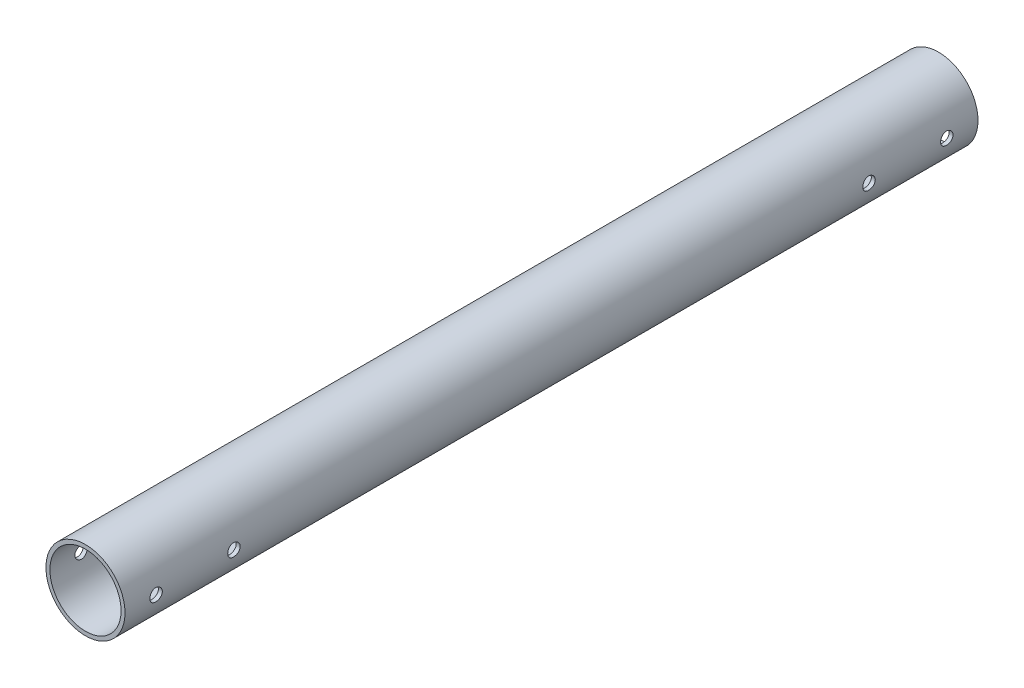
ISO-10303-21;
HEADER;
FILE_DESCRIPTION(('STEP AP214'),'2;1');
FILE_NAME('part.step','',(''),(''),'','','');
FILE_SCHEMA(('AUTOMOTIVE_DESIGN { 1 0 10303 214 1 1 1 1 }'));
ENDSEC;
DATA;
#1=APPLICATION_CONTEXT('core data for automotive mechanical design processes');
#2=APPLICATION_PROTOCOL_DEFINITION('international standard','automotive_design',2000,#1);
#3=PRODUCT_CONTEXT('',#1,'mechanical');
#4=PRODUCT('Part','Part','',(#3));
#5=PRODUCT_RELATED_PRODUCT_CATEGORY('part','',(#4));
#6=PRODUCT_DEFINITION_FORMATION('','',#4);
#7=PRODUCT_DEFINITION_CONTEXT('part definition',#1,'design');
#8=PRODUCT_DEFINITION('design','',#6,#7);
#9=PRODUCT_DEFINITION_SHAPE('','',#8);
#10=(LENGTH_UNIT() NAMED_UNIT(*) SI_UNIT(.MILLI.,.METRE.));
#11=(NAMED_UNIT(*) PLANE_ANGLE_UNIT() SI_UNIT($,.RADIAN.));
#12=(NAMED_UNIT(*) SI_UNIT($,.STERADIAN.) SOLID_ANGLE_UNIT());
#13=UNCERTAINTY_MEASURE_WITH_UNIT(LENGTH_MEASURE(1.E-05),#10,'distance_accuracy_value','');
#14=(GEOMETRIC_REPRESENTATION_CONTEXT(3) GLOBAL_UNCERTAINTY_ASSIGNED_CONTEXT((#13)) GLOBAL_UNIT_ASSIGNED_CONTEXT((#10,
#11,#12)) REPRESENTATION_CONTEXT('',''));
#15=CARTESIAN_POINT('',(0.,0.,0.));
#16=DIRECTION('',(0.,0.,1.));
#17=DIRECTION('',(1.,0.,0.));
#18=AXIS2_PLACEMENT_3D('',#15,#16,#17);
#19=CARTESIAN_POINT('',(0.,0.,274.));
#20=DIRECTION('',(0.,0.,1.));
#21=DIRECTION('',(1.,0.,0.));
#22=AXIS2_PLACEMENT_3D('',#19,#20,#21);
#23=PLANE('',#22);
#24=CARTESIAN_POINT('',(0.,0.,274.));
#25=DIRECTION('',(0.,0.,1.));
#26=DIRECTION('',(1.,0.,0.));
#27=AXIS2_PLACEMENT_3D('',#24,#25,#26);
#28=CIRCLE('',#27,12.7);
#29=CARTESIAN_POINT('',(12.7,0.,274.));
#30=VERTEX_POINT('',#29);
#31=EDGE_CURVE('E10',#30,#30,#28,.T.);
#32=ORIENTED_EDGE('',*,*,#31,.T.);
#33=EDGE_LOOP('',(#32));
#34=FACE_BOUND('',#33,.T.);
#35=CARTESIAN_POINT('',(0.,0.,274.));
#36=DIRECTION('',(0.,0.,1.));
#37=DIRECTION('',(1.,0.,0.));
#38=AXIS2_PLACEMENT_3D('',#35,#36,#37);
#39=CIRCLE('',#38,11.43);
#40=CARTESIAN_POINT('',(11.43,0.,274.));
#41=VERTEX_POINT('',#40);
#42=EDGE_CURVE('E63',#41,#41,#39,.T.);
#43=ORIENTED_EDGE('',*,*,#42,.F.);
#44=EDGE_LOOP('',(#43));
#45=FACE_BOUND('',#44,.T.);
#46=ADVANCED_FACE('F43',(#34,#45),#23,.T.);
#47=CARTESIAN_POINT('',(0.,0.,0.));
#48=DIRECTION('',(0.,0.,1.));
#49=DIRECTION('',(1.,0.,0.));
#50=AXIS2_PLACEMENT_3D('',#47,#48,#49);
#51=PLANE('',#50);
#52=CARTESIAN_POINT('',(0.,0.,0.));
#53=DIRECTION('',(0.,0.,1.));
#54=DIRECTION('',(1.,0.,0.));
#55=AXIS2_PLACEMENT_3D('',#52,#53,#54);
#56=CIRCLE('',#55,12.7);
#57=CARTESIAN_POINT('',(12.7,0.,0.));
#58=VERTEX_POINT('',#57);
#59=EDGE_CURVE('E59',#58,#58,#56,.T.);
#60=ORIENTED_EDGE('',*,*,#59,.F.);
#61=EDGE_LOOP('',(#60));
#62=FACE_BOUND('',#61,.T.);
#63=CARTESIAN_POINT('',(0.,0.,0.));
#64=DIRECTION('',(0.,0.,1.));
#65=DIRECTION('',(1.,0.,0.));
#66=AXIS2_PLACEMENT_3D('',#63,#64,#65);
#67=CIRCLE('',#66,11.43);
#68=CARTESIAN_POINT('',(11.43,0.,0.));
#69=VERTEX_POINT('',#68);
#70=EDGE_CURVE('E70',#69,#69,#67,.T.);
#71=ORIENTED_EDGE('',*,*,#70,.T.);
#72=EDGE_LOOP('',(#71));
#73=FACE_BOUND('',#72,.T.);
#74=ADVANCED_FACE('F224',(#62,#73),#51,.F.);
#75=CARTESIAN_POINT('',(0.,0.,274.));
#76=DIRECTION('',(0.,0.,-1.));
#77=DIRECTION('',(-1.,0.,0.));
#78=AXIS2_PLACEMENT_3D('',#75,#76,#77);
#79=CYLINDRICAL_SURFACE('',#78,12.7);
#80=CARTESIAN_POINT('',(-12.7,0.,8.));
#81=CARTESIAN_POINT('',(-12.6999981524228,0.111600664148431,8.00000454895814));
#82=CARTESIAN_POINT('',(-12.6985135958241,0.223264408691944,8.00937257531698));
#83=CARTESIAN_POINT('',(-12.6927343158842,0.443466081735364,8.04658502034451));
#84=CARTESIAN_POINT('',(-12.688436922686,0.552000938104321,8.07444699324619));
#85=CARTESIAN_POINT('',(-12.6775144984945,0.762726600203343,8.14779024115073));
#86=CARTESIAN_POINT('',(-12.6708912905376,0.864922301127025,8.19325771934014));
#87=CARTESIAN_POINT('',(-12.656047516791,1.06021942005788,8.30048653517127));
#88=CARTESIAN_POINT('',(-12.6478271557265,1.15332200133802,8.36224578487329));
#89=CARTESIAN_POINT('',(-12.6306231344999,1.32860297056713,8.5008689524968));
#90=CARTESIAN_POINT('',(-12.6216341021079,1.41069206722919,8.57784511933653));
#91=CARTESIAN_POINT('',(-12.6039474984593,1.56084506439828,8.74447546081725));
#92=CARTESIAN_POINT('',(-12.5952499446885,1.62890812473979,8.83413039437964));
#93=CARTESIAN_POINT('',(-12.5790789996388,1.74942910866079,9.024179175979));
#94=CARTESIAN_POINT('',(-12.5716125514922,1.80179980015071,9.12462898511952));
#95=CARTESIAN_POINT('',(-12.5588230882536,1.88889181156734,9.33303660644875));
#96=CARTESIAN_POINT('',(-12.5534999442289,1.9236141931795,9.44099396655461));
#97=CARTESIAN_POINT('',(-12.5456529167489,1.97414485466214,9.66040975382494));
#98=CARTESIAN_POINT('',(-12.5431063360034,1.99010658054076,9.77183201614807));
#99=CARTESIAN_POINT('',(-12.5410319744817,2.00313837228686,9.99580028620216));
#100=CARTESIAN_POINT('',(-12.5415040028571,2.00020963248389,10.1083462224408));
#101=CARTESIAN_POINT('',(-12.5453927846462,1.97566884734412,10.3302781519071));
#102=CARTESIAN_POINT('',(-12.5487825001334,1.9542283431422,10.4396836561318));
#103=CARTESIAN_POINT('',(-12.5580824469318,1.893541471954,10.6533247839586));
#104=CARTESIAN_POINT('',(-12.563992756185,1.85429455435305,10.7575602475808));
#105=CARTESIAN_POINT('',(-12.5776975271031,1.75893248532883,10.9584206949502));
#106=CARTESIAN_POINT('',(-12.5855000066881,1.70274529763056,11.0550109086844));
#107=CARTESIAN_POINT('',(-12.6021042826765,1.57514886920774,11.237457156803));
#108=CARTESIAN_POINT('',(-12.6109061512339,1.50373852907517,11.3233124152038));
#109=CARTESIAN_POINT('',(-12.6286366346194,1.34678429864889,11.4828452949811));
#110=CARTESIAN_POINT('',(-12.6375655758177,1.2610930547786,11.5563779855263));
#111=CARTESIAN_POINT('',(-12.6544540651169,1.07851000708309,11.6880414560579));
#112=CARTESIAN_POINT('',(-12.6624136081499,0.981618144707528,11.7461721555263));
#113=CARTESIAN_POINT('',(-12.6764760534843,0.779253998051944,11.8453914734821));
#114=CARTESIAN_POINT('',(-12.6825776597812,0.673775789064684,11.8864682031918));
#115=CARTESIAN_POINT('',(-12.6922261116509,0.457300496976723,11.9502838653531));
#116=CARTESIAN_POINT('',(-12.6957731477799,0.34630382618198,11.9730241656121));
#117=CARTESIAN_POINT('',(-12.6998873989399,0.123192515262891,11.9993271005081));
#118=CARTESIAN_POINT('',(-12.7004855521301,0.0111019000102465,12.0030888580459));
#119=CARTESIAN_POINT('',(-12.6987190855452,-0.212108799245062,11.9918574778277));
#120=CARTESIAN_POINT('',(-12.6963545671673,-0.323228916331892,11.9768649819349));
#121=CARTESIAN_POINT('',(-12.6889475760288,-0.540735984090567,11.9287162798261));
#122=CARTESIAN_POINT('',(-12.6839195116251,-0.647145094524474,11.8956577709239));
#123=CARTESIAN_POINT('',(-12.6717471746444,-0.852910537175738,11.8124189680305));
#124=CARTESIAN_POINT('',(-12.6646027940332,-0.952266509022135,11.7622377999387));
#125=CARTESIAN_POINT('',(-12.6489143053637,-1.14197626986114,11.6457158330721));
#126=CARTESIAN_POINT('',(-12.64035950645,-1.23225209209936,11.5792495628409));
#127=CARTESIAN_POINT('',(-12.6228338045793,-1.40043925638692,11.4322178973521));
#128=CARTESIAN_POINT('',(-12.6138628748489,-1.47834980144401,11.3516515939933));
#129=CARTESIAN_POINT('',(-12.5964170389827,-1.62032529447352,11.1778174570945));
#130=CARTESIAN_POINT('',(-12.5879474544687,-1.68425629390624,11.0844396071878));
#131=CARTESIAN_POINT('',(-12.5725597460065,-1.79552493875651,10.8881532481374));
#132=CARTESIAN_POINT('',(-12.5656415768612,-1.84286306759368,10.785245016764));
#133=CARTESIAN_POINT('',(-12.5541791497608,-1.91939776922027,10.5732076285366));
#134=CARTESIAN_POINT('',(-12.5496258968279,-1.94866316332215,10.4641038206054));
#135=CARTESIAN_POINT('',(-12.5433855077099,-1.98843966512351,10.2424521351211));
#136=CARTESIAN_POINT('',(-12.5416981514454,-1.99895221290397,10.1299045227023));
#137=CARTESIAN_POINT('',(-12.5413893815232,-2.00088776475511,9.90589618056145));
#138=CARTESIAN_POINT('',(-12.5427341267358,-1.99252147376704,9.79443726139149));
#139=CARTESIAN_POINT('',(-12.5482642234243,-1.95739014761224,9.57453327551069));
#140=CARTESIAN_POINT('',(-12.5524495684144,-1.93062515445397,9.46608820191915));
#141=CARTESIAN_POINT('',(-12.5631769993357,-1.8595334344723,9.25535875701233));
#142=CARTESIAN_POINT('',(-12.569716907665,-1.81522293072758,9.15306879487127));
#143=CARTESIAN_POINT('',(-12.5844189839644,-1.71031923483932,8.95734065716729));
#144=CARTESIAN_POINT('',(-12.5925812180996,-1.6497253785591,8.86390284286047));
#145=CARTESIAN_POINT('',(-12.609716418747,-1.51321535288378,8.68746339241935));
#146=CARTESIAN_POINT('',(-12.6186970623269,-1.4371435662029,8.60458288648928));
#147=CARTESIAN_POINT('',(-12.6363943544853,-1.27216585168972,8.45269006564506));
#148=CARTESIAN_POINT('',(-12.645110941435,-1.18325695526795,8.38368096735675));
#149=CARTESIAN_POINT('',(-12.6613592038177,-0.994487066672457,8.26110942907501));
#150=CARTESIAN_POINT('',(-12.6688833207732,-0.894562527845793,8.20764385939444));
#151=CARTESIAN_POINT('',(-12.6818250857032,-0.687076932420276,8.11833699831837));
#152=CARTESIAN_POINT('',(-12.6872448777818,-0.579523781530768,8.08247775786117));
#153=CARTESIAN_POINT('',(-12.6941538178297,-0.392929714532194,8.03738375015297));
#154=CARTESIAN_POINT('',(-12.6963346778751,-0.3150309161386,8.02338671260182));
#155=CARTESIAN_POINT('',(-12.699258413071,-0.158098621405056,8.00469329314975));
#156=CARTESIAN_POINT('',(-12.7000013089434,-0.0790651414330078,7.99999677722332));
#157=CARTESIAN_POINT('',(-12.7,0.,8.));
#158=B_SPLINE_CURVE_WITH_KNOTS('',3,(#80,#81,#82,#83,#84,#85,#86,#87,#88,#89,#90,#91,#92,#93,
#94,#95,#96,#97,#98,#99,#100,#101,#102,#103,#104,#105,#106,#107,#108,#109,#110,#111,#112,#113,
#114,#115,#116,#117,#118,#119,#120,#121,#122,#123,#124,#125,#126,#127,#128,#129,#130,#131,#132,
#133,#134,#135,#136,#137,#138,#139,#140,#141,#142,#143,#144,#145,#146,#147,#148,#149,#150,#151,
#152,#153,#154,#155,#156,#157),.UNSPECIFIED.,.T.,.F.,(4,2,2,2,2,2,2,2,2,2,2,2,2,2,2,2,2,2,2,2,2,
2,2,2,2,2,2,2,2,2,2,2,2,2,2,2,2,2,4),(0.,0.334513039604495,0.669344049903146,1.00391319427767,
1.33843948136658,1.67553227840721,2.0126452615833,2.35159886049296,2.69053206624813,
3.02667336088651,3.36279340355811,3.69583178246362,4.02888046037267,4.36336585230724,
4.69787540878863,5.03607855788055,5.37428347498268,5.71272376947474,6.05113881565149,
6.38599571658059,6.72084115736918,7.05389348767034,7.38696282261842,7.72268383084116,
8.05842646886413,8.39725738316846,8.73607842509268,9.07360114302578,9.4110979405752,
9.74484662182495,10.0785945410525,10.4120345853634,10.7454882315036,11.0824767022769,
11.4195432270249,11.758667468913,12.0974452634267,12.3344393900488,12.5714301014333),.UNSPECIFIED.);
#159=CARTESIAN_POINT('',(-12.7,0.,8.));
#160=VERTEX_POINT('',#159);
#161=EDGE_CURVE('E156',#160,#160,#158,.T.);
#162=ORIENTED_EDGE('',*,*,#161,.T.);
#163=EDGE_LOOP('',(#162));
#164=FACE_BOUND('',#163,.T.);
#165=CARTESIAN_POINT('',(12.7,0.,8.));
#166=CARTESIAN_POINT('',(12.6999981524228,-0.111600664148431,8.00000454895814));
#167=CARTESIAN_POINT('',(12.6985135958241,-0.223264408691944,8.00937257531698));
#168=CARTESIAN_POINT('',(12.6927343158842,-0.443466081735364,8.04658502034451));
#169=CARTESIAN_POINT('',(12.688436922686,-0.552000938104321,8.07444699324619));
#170=CARTESIAN_POINT('',(12.6775144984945,-0.762726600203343,8.14779024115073));
#171=CARTESIAN_POINT('',(12.6708912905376,-0.864922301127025,8.19325771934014));
#172=CARTESIAN_POINT('',(12.656047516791,-1.06021942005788,8.30048653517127));
#173=CARTESIAN_POINT('',(12.6478271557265,-1.15332200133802,8.36224578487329));
#174=CARTESIAN_POINT('',(12.6306231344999,-1.32860297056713,8.5008689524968));
#175=CARTESIAN_POINT('',(12.6216341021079,-1.41069206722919,8.57784511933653));
#176=CARTESIAN_POINT('',(12.6039474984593,-1.56084506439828,8.74447546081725));
#177=CARTESIAN_POINT('',(12.5952499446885,-1.62890812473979,8.83413039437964));
#178=CARTESIAN_POINT('',(12.5790789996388,-1.74942910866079,9.024179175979));
#179=CARTESIAN_POINT('',(12.5716125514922,-1.80179980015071,9.12462898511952));
#180=CARTESIAN_POINT('',(12.5588230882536,-1.88889181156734,9.33303660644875));
#181=CARTESIAN_POINT('',(12.5534999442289,-1.9236141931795,9.44099396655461));
#182=CARTESIAN_POINT('',(12.5456529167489,-1.97414485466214,9.66040975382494));
#183=CARTESIAN_POINT('',(12.5431063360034,-1.99010658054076,9.77183201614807));
#184=CARTESIAN_POINT('',(12.5410319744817,-2.00313837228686,9.99580028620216));
#185=CARTESIAN_POINT('',(12.5415040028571,-2.00020963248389,10.1083462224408));
#186=CARTESIAN_POINT('',(12.5453927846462,-1.97566884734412,10.3302781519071));
#187=CARTESIAN_POINT('',(12.5487825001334,-1.9542283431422,10.4396836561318));
#188=CARTESIAN_POINT('',(12.5580824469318,-1.893541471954,10.6533247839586));
#189=CARTESIAN_POINT('',(12.563992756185,-1.85429455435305,10.7575602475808));
#190=CARTESIAN_POINT('',(12.5776975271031,-1.75893248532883,10.9584206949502));
#191=CARTESIAN_POINT('',(12.5855000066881,-1.70274529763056,11.0550109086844));
#192=CARTESIAN_POINT('',(12.6021042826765,-1.57514886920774,11.237457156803));
#193=CARTESIAN_POINT('',(12.6109061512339,-1.50373852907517,11.3233124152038));
#194=CARTESIAN_POINT('',(12.6286366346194,-1.34678429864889,11.4828452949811));
#195=CARTESIAN_POINT('',(12.6375655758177,-1.2610930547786,11.5563779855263));
#196=CARTESIAN_POINT('',(12.6544540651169,-1.07851000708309,11.6880414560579));
#197=CARTESIAN_POINT('',(12.6624136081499,-0.981618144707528,11.7461721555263));
#198=CARTESIAN_POINT('',(12.6764760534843,-0.779253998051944,11.8453914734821));
#199=CARTESIAN_POINT('',(12.6825776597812,-0.673775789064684,11.8864682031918));
#200=CARTESIAN_POINT('',(12.6922261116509,-0.457300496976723,11.9502838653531));
#201=CARTESIAN_POINT('',(12.6957731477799,-0.34630382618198,11.9730241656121));
#202=CARTESIAN_POINT('',(12.6998873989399,-0.123192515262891,11.9993271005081));
#203=CARTESIAN_POINT('',(12.7004855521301,-0.0111019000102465,12.0030888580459));
#204=CARTESIAN_POINT('',(12.6987190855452,0.212108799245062,11.9918574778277));
#205=CARTESIAN_POINT('',(12.6963545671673,0.323228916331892,11.9768649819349));
#206=CARTESIAN_POINT('',(12.6889475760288,0.540735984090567,11.9287162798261));
#207=CARTESIAN_POINT('',(12.6839195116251,0.647145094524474,11.8956577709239));
#208=CARTESIAN_POINT('',(12.6717471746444,0.852910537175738,11.8124189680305));
#209=CARTESIAN_POINT('',(12.6646027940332,0.952266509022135,11.7622377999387));
#210=CARTESIAN_POINT('',(12.6489143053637,1.14197626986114,11.6457158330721));
#211=CARTESIAN_POINT('',(12.64035950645,1.23225209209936,11.5792495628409));
#212=CARTESIAN_POINT('',(12.6228338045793,1.40043925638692,11.4322178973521));
#213=CARTESIAN_POINT('',(12.6138628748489,1.47834980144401,11.3516515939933));
#214=CARTESIAN_POINT('',(12.5964170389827,1.62032529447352,11.1778174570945));
#215=CARTESIAN_POINT('',(12.5879474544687,1.68425629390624,11.0844396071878));
#216=CARTESIAN_POINT('',(12.5725597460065,1.79552493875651,10.8881532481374));
#217=CARTESIAN_POINT('',(12.5656415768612,1.84286306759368,10.785245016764));
#218=CARTESIAN_POINT('',(12.5541791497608,1.91939776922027,10.5732076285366));
#219=CARTESIAN_POINT('',(12.5496258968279,1.94866316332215,10.4641038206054));
#220=CARTESIAN_POINT('',(12.5433855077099,1.98843966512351,10.2424521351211));
#221=CARTESIAN_POINT('',(12.5416981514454,1.99895221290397,10.1299045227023));
#222=CARTESIAN_POINT('',(12.5413893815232,2.00088776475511,9.90589618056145));
#223=CARTESIAN_POINT('',(12.5427341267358,1.99252147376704,9.79443726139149));
#224=CARTESIAN_POINT('',(12.5482642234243,1.95739014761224,9.57453327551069));
#225=CARTESIAN_POINT('',(12.5524495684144,1.93062515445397,9.46608820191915));
#226=CARTESIAN_POINT('',(12.5631769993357,1.8595334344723,9.25535875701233));
#227=CARTESIAN_POINT('',(12.569716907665,1.81522293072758,9.15306879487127));
#228=CARTESIAN_POINT('',(12.5844189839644,1.71031923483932,8.95734065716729));
#229=CARTESIAN_POINT('',(12.5925812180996,1.6497253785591,8.86390284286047));
#230=CARTESIAN_POINT('',(12.609716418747,1.51321535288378,8.68746339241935));
#231=CARTESIAN_POINT('',(12.6186970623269,1.4371435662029,8.60458288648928));
#232=CARTESIAN_POINT('',(12.6363943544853,1.27216585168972,8.45269006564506));
#233=CARTESIAN_POINT('',(12.645110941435,1.18325695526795,8.38368096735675));
#234=CARTESIAN_POINT('',(12.6613592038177,0.994487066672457,8.26110942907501));
#235=CARTESIAN_POINT('',(12.6688833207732,0.894562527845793,8.20764385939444));
#236=CARTESIAN_POINT('',(12.6818250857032,0.687076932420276,8.11833699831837));
#237=CARTESIAN_POINT('',(12.6872448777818,0.579523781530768,8.08247775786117));
#238=CARTESIAN_POINT('',(12.6941538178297,0.392929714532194,8.03738375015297));
#239=CARTESIAN_POINT('',(12.6963346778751,0.3150309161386,8.02338671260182));
#240=CARTESIAN_POINT('',(12.699258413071,0.158098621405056,8.00469329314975));
#241=CARTESIAN_POINT('',(12.7000013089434,0.0790651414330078,7.99999677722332));
#242=CARTESIAN_POINT('',(12.7,0.,8.));
#243=B_SPLINE_CURVE_WITH_KNOTS('',3,(#165,#166,#167,#168,#169,#170,#171,#172,#173,#174,#175,
#176,#177,#178,#179,#180,#181,#182,#183,#184,#185,#186,#187,#188,#189,#190,#191,#192,#193,#194,
#195,#196,#197,#198,#199,#200,#201,#202,#203,#204,#205,#206,#207,#208,#209,#210,#211,#212,#213,
#214,#215,#216,#217,#218,#219,#220,#221,#222,#223,#224,#225,#226,#227,#228,#229,#230,#231,#232,
#233,#234,#235,#236,#237,#238,#239,#240,#241,#242),.UNSPECIFIED.,.T.,.F.,(4,2,2,2,2,2,2,2,2,2,2,
2,2,2,2,2,2,2,2,2,2,2,2,2,2,2,2,2,2,2,2,2,2,2,2,2,2,2,4),(0.,0.334513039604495,
0.669344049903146,1.00391319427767,1.33843948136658,1.67553227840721,2.0126452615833,
2.35159886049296,2.69053206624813,3.02667336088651,3.36279340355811,3.69583178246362,
4.02888046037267,4.36336585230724,4.69787540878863,5.03607855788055,5.37428347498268,
5.71272376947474,6.05113881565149,6.38599571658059,6.72084115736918,7.05389348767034,
7.38696282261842,7.72268383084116,8.05842646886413,8.39725738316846,8.73607842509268,
9.07360114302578,9.4110979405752,9.74484662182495,10.0785945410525,10.4120345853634,
10.7454882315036,11.0824767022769,11.4195432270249,11.758667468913,12.0974452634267,
12.3344393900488,12.5714301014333),.UNSPECIFIED.);
#244=CARTESIAN_POINT('',(12.7,0.,8.));
#245=VERTEX_POINT('',#244);
#246=EDGE_CURVE('E149',#245,#245,#243,.T.);
#247=ORIENTED_EDGE('',*,*,#246,.T.);
#248=EDGE_LOOP('',(#247));
#249=FACE_BOUND('',#248,.T.);
#250=CARTESIAN_POINT('',(-12.7,0.,237.));
#251=CARTESIAN_POINT('',(-12.6999981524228,0.11160066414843,237.000004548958));
#252=CARTESIAN_POINT('',(-12.6985135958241,0.223264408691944,237.009372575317));
#253=CARTESIAN_POINT('',(-12.6927343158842,0.443466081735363,237.046585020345));
#254=CARTESIAN_POINT('',(-12.688436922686,0.552000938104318,237.074446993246));
#255=CARTESIAN_POINT('',(-12.6775144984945,0.762726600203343,237.147790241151));
#256=CARTESIAN_POINT('',(-12.6708912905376,0.864922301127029,237.19325771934));
#257=CARTESIAN_POINT('',(-12.656047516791,1.06021942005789,237.300486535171));
#258=CARTESIAN_POINT('',(-12.6478271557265,1.15332200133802,237.362245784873));
#259=CARTESIAN_POINT('',(-12.6306231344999,1.32860297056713,237.500868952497));
#260=CARTESIAN_POINT('',(-12.6216341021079,1.41069206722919,237.577845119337));
#261=CARTESIAN_POINT('',(-12.6039474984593,1.56084506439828,237.744475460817));
#262=CARTESIAN_POINT('',(-12.5952499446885,1.62890812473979,237.83413039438));
#263=CARTESIAN_POINT('',(-12.5790789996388,1.74942910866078,238.024179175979));
#264=CARTESIAN_POINT('',(-12.5716125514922,1.80179980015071,238.12462898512));
#265=CARTESIAN_POINT('',(-12.5588230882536,1.88889181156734,238.333036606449));
#266=CARTESIAN_POINT('',(-12.5534999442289,1.9236141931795,238.440993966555));
#267=CARTESIAN_POINT('',(-12.5456529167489,1.97414485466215,238.660409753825));
#268=CARTESIAN_POINT('',(-12.5431063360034,1.99010658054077,238.771832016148));
#269=CARTESIAN_POINT('',(-12.5410319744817,2.00313837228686,238.995800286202));
#270=CARTESIAN_POINT('',(-12.5415040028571,2.00020963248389,239.108346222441));
#271=CARTESIAN_POINT('',(-12.5453927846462,1.97566884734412,239.330278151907));
#272=CARTESIAN_POINT('',(-12.5487825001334,1.9542283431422,239.439683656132));
#273=CARTESIAN_POINT('',(-12.5580824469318,1.893541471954,239.653324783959));
#274=CARTESIAN_POINT('',(-12.563992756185,1.85429455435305,239.757560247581));
#275=CARTESIAN_POINT('',(-12.5776975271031,1.75893248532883,239.95842069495));
#276=CARTESIAN_POINT('',(-12.5855000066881,1.70274529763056,240.055010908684));
#277=CARTESIAN_POINT('',(-12.6021042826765,1.57514886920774,240.237457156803));
#278=CARTESIAN_POINT('',(-12.6109061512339,1.50373852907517,240.323312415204));
#279=CARTESIAN_POINT('',(-12.6286366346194,1.3467842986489,240.482845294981));
#280=CARTESIAN_POINT('',(-12.6375655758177,1.2610930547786,240.556377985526));
#281=CARTESIAN_POINT('',(-12.6544540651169,1.07851000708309,240.688041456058));
#282=CARTESIAN_POINT('',(-12.6624136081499,0.98161814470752,240.746172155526));
#283=CARTESIAN_POINT('',(-12.6764760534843,0.77925399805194,240.845391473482));
#284=CARTESIAN_POINT('',(-12.6825776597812,0.673775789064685,240.886468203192));
#285=CARTESIAN_POINT('',(-12.6922261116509,0.45730049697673,240.950283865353));
#286=CARTESIAN_POINT('',(-12.6957731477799,0.346303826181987,240.973024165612));
#287=CARTESIAN_POINT('',(-12.6998873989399,0.123192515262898,240.999327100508));
#288=CARTESIAN_POINT('',(-12.7004855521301,0.0111019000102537,241.003088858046));
#289=CARTESIAN_POINT('',(-12.6987190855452,-0.212108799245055,240.991857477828));
#290=CARTESIAN_POINT('',(-12.6963545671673,-0.323228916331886,240.976864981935));
#291=CARTESIAN_POINT('',(-12.6889475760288,-0.540735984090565,240.928716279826));
#292=CARTESIAN_POINT('',(-12.6839195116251,-0.647145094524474,240.895657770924));
#293=CARTESIAN_POINT('',(-12.6717471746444,-0.85291053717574,240.81241896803));
#294=CARTESIAN_POINT('',(-12.6646027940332,-0.952266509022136,240.762237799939));
#295=CARTESIAN_POINT('',(-12.6489143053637,-1.14197626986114,240.645715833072));
#296=CARTESIAN_POINT('',(-12.64035950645,-1.23225209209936,240.579249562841));
#297=CARTESIAN_POINT('',(-12.6228338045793,-1.40043925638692,240.432217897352));
#298=CARTESIAN_POINT('',(-12.6138628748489,-1.47834980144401,240.351651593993));
#299=CARTESIAN_POINT('',(-12.5964170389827,-1.62032529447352,240.177817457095));
#300=CARTESIAN_POINT('',(-12.5879474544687,-1.68425629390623,240.084439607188));
#301=CARTESIAN_POINT('',(-12.5725597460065,-1.79552493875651,239.888153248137));
#302=CARTESIAN_POINT('',(-12.5656415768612,-1.84286306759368,239.785245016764));
#303=CARTESIAN_POINT('',(-12.5541791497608,-1.91939776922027,239.573207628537));
#304=CARTESIAN_POINT('',(-12.5496258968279,-1.94866316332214,239.464103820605));
#305=CARTESIAN_POINT('',(-12.5433855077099,-1.98843966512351,239.242452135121));
#306=CARTESIAN_POINT('',(-12.5416981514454,-1.99895221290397,239.129904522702));
#307=CARTESIAN_POINT('',(-12.5413893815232,-2.00088776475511,238.905896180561));
#308=CARTESIAN_POINT('',(-12.5427341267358,-1.99252147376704,238.794437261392));
#309=CARTESIAN_POINT('',(-12.5482642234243,-1.95739014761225,238.574533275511));
#310=CARTESIAN_POINT('',(-12.5524495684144,-1.93062515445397,238.466088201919));
#311=CARTESIAN_POINT('',(-12.5631769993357,-1.8595334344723,238.255358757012));
#312=CARTESIAN_POINT('',(-12.569716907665,-1.81522293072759,238.153068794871));
#313=CARTESIAN_POINT('',(-12.5844189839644,-1.71031923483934,237.957340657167));
#314=CARTESIAN_POINT('',(-12.5925812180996,-1.64972537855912,237.863902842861));
#315=CARTESIAN_POINT('',(-12.609716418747,-1.5132153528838,237.687463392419));
#316=CARTESIAN_POINT('',(-12.6186970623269,-1.43714356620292,237.604582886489));
#317=CARTESIAN_POINT('',(-12.6363943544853,-1.27216585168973,237.452690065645));
#318=CARTESIAN_POINT('',(-12.645110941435,-1.18325695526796,237.383680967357));
#319=CARTESIAN_POINT('',(-12.6613592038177,-0.99448706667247,237.261109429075));
#320=CARTESIAN_POINT('',(-12.6688833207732,-0.894562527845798,237.207643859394));
#321=CARTESIAN_POINT('',(-12.6818250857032,-0.687076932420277,237.118336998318));
#322=CARTESIAN_POINT('',(-12.6872448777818,-0.579523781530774,237.082477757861));
#323=CARTESIAN_POINT('',(-12.6941538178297,-0.392929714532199,237.037383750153));
#324=CARTESIAN_POINT('',(-12.6963346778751,-0.315030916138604,237.023386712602));
#325=CARTESIAN_POINT('',(-12.699258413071,-0.158098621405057,237.00469329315));
#326=CARTESIAN_POINT('',(-12.7000013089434,-0.0790651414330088,236.999996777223));
#327=CARTESIAN_POINT('',(-12.7,0.,237.));
#328=B_SPLINE_CURVE_WITH_KNOTS('',3,(#250,#251,#252,#253,#254,#255,#256,#257,#258,#259,#260,
#261,#262,#263,#264,#265,#266,#267,#268,#269,#270,#271,#272,#273,#274,#275,#276,#277,#278,#279,
#280,#281,#282,#283,#284,#285,#286,#287,#288,#289,#290,#291,#292,#293,#294,#295,#296,#297,#298,
#299,#300,#301,#302,#303,#304,#305,#306,#307,#308,#309,#310,#311,#312,#313,#314,#315,#316,#317,
#318,#319,#320,#321,#322,#323,#324,#325,#326,#327),.UNSPECIFIED.,.T.,.F.,(4,2,2,2,2,2,2,2,2,2,2,
2,2,2,2,2,2,2,2,2,2,2,2,2,2,2,2,2,2,2,2,2,2,2,2,2,2,2,4),(0.,0.334513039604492,
0.669344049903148,1.00391319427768,1.33843948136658,1.67553227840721,2.0126452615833,
2.35159886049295,2.69053206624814,3.02667336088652,3.36279340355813,3.69583178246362,
4.02888046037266,4.36336585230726,4.69787540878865,5.03607855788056,5.37428347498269,
5.71272376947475,6.05113881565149,6.38599571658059,6.72084115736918,7.05389348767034,
7.38696282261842,7.72268383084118,8.05842646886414,8.39725738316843,8.73607842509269,
9.07360114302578,9.41109794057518,9.74484662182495,10.0785945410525,10.4120345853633,
10.7454882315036,11.0824767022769,11.4195432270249,11.758667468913,12.0974452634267,
12.3344393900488,12.5714301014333),.UNSPECIFIED.);
#329=CARTESIAN_POINT('',(-12.7,0.,237.));
#330=VERTEX_POINT('',#329);
#331=EDGE_CURVE('E137',#330,#330,#328,.T.);
#332=ORIENTED_EDGE('',*,*,#331,.T.);
#333=EDGE_LOOP('',(#332));
#334=FACE_BOUND('',#333,.T.);
#335=CARTESIAN_POINT('',(12.7,0.,237.));
#336=CARTESIAN_POINT('',(12.6999981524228,-0.11160066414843,237.000004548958));
#337=CARTESIAN_POINT('',(12.6985135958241,-0.223264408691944,237.009372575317));
#338=CARTESIAN_POINT('',(12.6927343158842,-0.443466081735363,237.046585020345));
#339=CARTESIAN_POINT('',(12.688436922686,-0.552000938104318,237.074446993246));
#340=CARTESIAN_POINT('',(12.6775144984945,-0.762726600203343,237.147790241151));
#341=CARTESIAN_POINT('',(12.6708912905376,-0.864922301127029,237.19325771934));
#342=CARTESIAN_POINT('',(12.656047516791,-1.06021942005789,237.300486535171));
#343=CARTESIAN_POINT('',(12.6478271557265,-1.15332200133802,237.362245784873));
#344=CARTESIAN_POINT('',(12.6306231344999,-1.32860297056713,237.500868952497));
#345=CARTESIAN_POINT('',(12.6216341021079,-1.41069206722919,237.577845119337));
#346=CARTESIAN_POINT('',(12.6039474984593,-1.56084506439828,237.744475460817));
#347=CARTESIAN_POINT('',(12.5952499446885,-1.62890812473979,237.83413039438));
#348=CARTESIAN_POINT('',(12.5790789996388,-1.74942910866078,238.024179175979));
#349=CARTESIAN_POINT('',(12.5716125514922,-1.80179980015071,238.12462898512));
#350=CARTESIAN_POINT('',(12.5588230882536,-1.88889181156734,238.333036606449));
#351=CARTESIAN_POINT('',(12.5534999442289,-1.9236141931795,238.440993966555));
#352=CARTESIAN_POINT('',(12.5456529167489,-1.97414485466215,238.660409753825));
#353=CARTESIAN_POINT('',(12.5431063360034,-1.99010658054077,238.771832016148));
#354=CARTESIAN_POINT('',(12.5410319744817,-2.00313837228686,238.995800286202));
#355=CARTESIAN_POINT('',(12.5415040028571,-2.00020963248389,239.108346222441));
#356=CARTESIAN_POINT('',(12.5453927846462,-1.97566884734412,239.330278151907));
#357=CARTESIAN_POINT('',(12.5487825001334,-1.9542283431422,239.439683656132));
#358=CARTESIAN_POINT('',(12.5580824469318,-1.893541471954,239.653324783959));
#359=CARTESIAN_POINT('',(12.563992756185,-1.85429455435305,239.757560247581));
#360=CARTESIAN_POINT('',(12.5776975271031,-1.75893248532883,239.95842069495));
#361=CARTESIAN_POINT('',(12.5855000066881,-1.70274529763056,240.055010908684));
#362=CARTESIAN_POINT('',(12.6021042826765,-1.57514886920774,240.237457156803));
#363=CARTESIAN_POINT('',(12.6109061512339,-1.50373852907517,240.323312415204));
#364=CARTESIAN_POINT('',(12.6286366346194,-1.3467842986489,240.482845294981));
#365=CARTESIAN_POINT('',(12.6375655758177,-1.2610930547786,240.556377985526));
#366=CARTESIAN_POINT('',(12.6544540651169,-1.07851000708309,240.688041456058));
#367=CARTESIAN_POINT('',(12.6624136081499,-0.98161814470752,240.746172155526));
#368=CARTESIAN_POINT('',(12.6764760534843,-0.77925399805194,240.845391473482));
#369=CARTESIAN_POINT('',(12.6825776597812,-0.673775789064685,240.886468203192));
#370=CARTESIAN_POINT('',(12.6922261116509,-0.45730049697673,240.950283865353));
#371=CARTESIAN_POINT('',(12.6957731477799,-0.346303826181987,240.973024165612));
#372=CARTESIAN_POINT('',(12.6998873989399,-0.123192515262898,240.999327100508));
#373=CARTESIAN_POINT('',(12.7004855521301,-0.0111019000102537,241.003088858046));
#374=CARTESIAN_POINT('',(12.6987190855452,0.212108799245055,240.991857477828));
#375=CARTESIAN_POINT('',(12.6963545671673,0.323228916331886,240.976864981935));
#376=CARTESIAN_POINT('',(12.6889475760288,0.540735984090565,240.928716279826));
#377=CARTESIAN_POINT('',(12.6839195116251,0.647145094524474,240.895657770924));
#378=CARTESIAN_POINT('',(12.6717471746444,0.85291053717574,240.81241896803));
#379=CARTESIAN_POINT('',(12.6646027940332,0.952266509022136,240.762237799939));
#380=CARTESIAN_POINT('',(12.6489143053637,1.14197626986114,240.645715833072));
#381=CARTESIAN_POINT('',(12.64035950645,1.23225209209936,240.579249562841));
#382=CARTESIAN_POINT('',(12.6228338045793,1.40043925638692,240.432217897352));
#383=CARTESIAN_POINT('',(12.6138628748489,1.47834980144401,240.351651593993));
#384=CARTESIAN_POINT('',(12.5964170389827,1.62032529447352,240.177817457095));
#385=CARTESIAN_POINT('',(12.5879474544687,1.68425629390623,240.084439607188));
#386=CARTESIAN_POINT('',(12.5725597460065,1.79552493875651,239.888153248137));
#387=CARTESIAN_POINT('',(12.5656415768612,1.84286306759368,239.785245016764));
#388=CARTESIAN_POINT('',(12.5541791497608,1.91939776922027,239.573207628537));
#389=CARTESIAN_POINT('',(12.5496258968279,1.94866316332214,239.464103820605));
#390=CARTESIAN_POINT('',(12.5433855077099,1.98843966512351,239.242452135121));
#391=CARTESIAN_POINT('',(12.5416981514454,1.99895221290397,239.129904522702));
#392=CARTESIAN_POINT('',(12.5413893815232,2.00088776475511,238.905896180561));
#393=CARTESIAN_POINT('',(12.5427341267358,1.99252147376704,238.794437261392));
#394=CARTESIAN_POINT('',(12.5482642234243,1.95739014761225,238.574533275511));
#395=CARTESIAN_POINT('',(12.5524495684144,1.93062515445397,238.466088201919));
#396=CARTESIAN_POINT('',(12.5631769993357,1.8595334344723,238.255358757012));
#397=CARTESIAN_POINT('',(12.569716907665,1.81522293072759,238.153068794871));
#398=CARTESIAN_POINT('',(12.5844189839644,1.71031923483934,237.957340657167));
#399=CARTESIAN_POINT('',(12.5925812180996,1.64972537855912,237.863902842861));
#400=CARTESIAN_POINT('',(12.609716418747,1.5132153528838,237.687463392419));
#401=CARTESIAN_POINT('',(12.6186970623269,1.43714356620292,237.604582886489));
#402=CARTESIAN_POINT('',(12.6363943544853,1.27216585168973,237.452690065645));
#403=CARTESIAN_POINT('',(12.645110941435,1.18325695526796,237.383680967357));
#404=CARTESIAN_POINT('',(12.6613592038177,0.99448706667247,237.261109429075));
#405=CARTESIAN_POINT('',(12.6688833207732,0.894562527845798,237.207643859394));
#406=CARTESIAN_POINT('',(12.6818250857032,0.687076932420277,237.118336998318));
#407=CARTESIAN_POINT('',(12.6872448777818,0.579523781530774,237.082477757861));
#408=CARTESIAN_POINT('',(12.6941538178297,0.392929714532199,237.037383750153));
#409=CARTESIAN_POINT('',(12.6963346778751,0.315030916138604,237.023386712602));
#410=CARTESIAN_POINT('',(12.699258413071,0.158098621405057,237.00469329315));
#411=CARTESIAN_POINT('',(12.7000013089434,0.0790651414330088,236.999996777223));
#412=CARTESIAN_POINT('',(12.7,0.,237.));
#413=B_SPLINE_CURVE_WITH_KNOTS('',3,(#335,#336,#337,#338,#339,#340,#341,#342,#343,#344,#345,
#346,#347,#348,#349,#350,#351,#352,#353,#354,#355,#356,#357,#358,#359,#360,#361,#362,#363,#364,
#365,#366,#367,#368,#369,#370,#371,#372,#373,#374,#375,#376,#377,#378,#379,#380,#381,#382,#383,
#384,#385,#386,#387,#388,#389,#390,#391,#392,#393,#394,#395,#396,#397,#398,#399,#400,#401,#402,
#403,#404,#405,#406,#407,#408,#409,#410,#411,#412),.UNSPECIFIED.,.T.,.F.,(4,2,2,2,2,2,2,2,2,2,2,
2,2,2,2,2,2,2,2,2,2,2,2,2,2,2,2,2,2,2,2,2,2,2,2,2,2,2,4),(0.,0.334513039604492,
0.669344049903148,1.00391319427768,1.33843948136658,1.67553227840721,2.0126452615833,
2.35159886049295,2.69053206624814,3.02667336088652,3.36279340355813,3.69583178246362,
4.02888046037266,4.36336585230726,4.69787540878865,5.03607855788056,5.37428347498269,
5.71272376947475,6.05113881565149,6.38599571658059,6.72084115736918,7.05389348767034,
7.38696282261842,7.72268383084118,8.05842646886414,8.39725738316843,8.73607842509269,
9.07360114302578,9.41109794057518,9.74484662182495,10.0785945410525,10.4120345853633,
10.7454882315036,11.0824767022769,11.4195432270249,11.758667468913,12.0974452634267,
12.3344393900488,12.5714301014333),.UNSPECIFIED.);
#414=CARTESIAN_POINT('',(12.7,0.,237.));
#415=VERTEX_POINT('',#414);
#416=EDGE_CURVE('E134',#415,#415,#413,.T.);
#417=ORIENTED_EDGE('',*,*,#416,.T.);
#418=EDGE_LOOP('',(#417));
#419=FACE_BOUND('',#418,.T.);
#420=CARTESIAN_POINT('',(-12.7,0.,262.));
#421=CARTESIAN_POINT('',(-12.6999981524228,0.111600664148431,262.000004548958));
#422=CARTESIAN_POINT('',(-12.6985135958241,0.223264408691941,262.009372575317));
#423=CARTESIAN_POINT('',(-12.6927343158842,0.443466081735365,262.046585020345));
#424=CARTESIAN_POINT('',(-12.688436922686,0.55200093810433,262.074446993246));
#425=CARTESIAN_POINT('',(-12.6775144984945,0.762726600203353,262.147790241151));
#426=CARTESIAN_POINT('',(-12.6708912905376,0.864922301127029,262.19325771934));
#427=CARTESIAN_POINT('',(-12.656047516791,1.06021942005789,262.300486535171));
#428=CARTESIAN_POINT('',(-12.6478271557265,1.15332200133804,262.362245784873));
#429=CARTESIAN_POINT('',(-12.6306231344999,1.32860297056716,262.500868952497));
#430=CARTESIAN_POINT('',(-12.6216341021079,1.41069206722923,262.577845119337));
#431=CARTESIAN_POINT('',(-12.6039474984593,1.56084506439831,262.744475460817));
#432=CARTESIAN_POINT('',(-12.5952499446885,1.62890812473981,262.83413039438));
#433=CARTESIAN_POINT('',(-12.5790789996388,1.74942910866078,263.024179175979));
#434=CARTESIAN_POINT('',(-12.5716125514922,1.8017998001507,263.12462898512));
#435=CARTESIAN_POINT('',(-12.5588230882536,1.88889181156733,263.333036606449));
#436=CARTESIAN_POINT('',(-12.5534999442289,1.92361419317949,263.440993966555));
#437=CARTESIAN_POINT('',(-12.5456529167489,1.97414485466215,263.660409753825));
#438=CARTESIAN_POINT('',(-12.5431063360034,1.99010658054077,263.771832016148));
#439=CARTESIAN_POINT('',(-12.5410319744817,2.00313837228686,263.995800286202));
#440=CARTESIAN_POINT('',(-12.5415040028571,2.00020963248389,264.108346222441));
#441=CARTESIAN_POINT('',(-12.5453927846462,1.97566884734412,264.330278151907));
#442=CARTESIAN_POINT('',(-12.5487825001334,1.9542283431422,264.439683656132));
#443=CARTESIAN_POINT('',(-12.5580824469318,1.893541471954,264.653324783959));
#444=CARTESIAN_POINT('',(-12.563992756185,1.85429455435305,264.757560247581));
#445=CARTESIAN_POINT('',(-12.5776975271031,1.75893248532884,264.95842069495));
#446=CARTESIAN_POINT('',(-12.5855000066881,1.70274529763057,265.055010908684));
#447=CARTESIAN_POINT('',(-12.6021042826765,1.57514886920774,265.237457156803));
#448=CARTESIAN_POINT('',(-12.6109061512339,1.50373852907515,265.323312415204));
#449=CARTESIAN_POINT('',(-12.6286366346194,1.34678429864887,265.482845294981));
#450=CARTESIAN_POINT('',(-12.6375655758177,1.26109305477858,265.556377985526));
#451=CARTESIAN_POINT('',(-12.6544540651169,1.07851000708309,265.688041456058));
#452=CARTESIAN_POINT('',(-12.6624136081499,0.981618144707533,265.746172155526));
#453=CARTESIAN_POINT('',(-12.6764760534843,0.779253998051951,265.845391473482));
#454=CARTESIAN_POINT('',(-12.6825776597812,0.673775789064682,265.886468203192));
#455=CARTESIAN_POINT('',(-12.6922261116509,0.457300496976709,265.950283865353));
#456=CARTESIAN_POINT('',(-12.6957731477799,0.346303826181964,265.973024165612));
#457=CARTESIAN_POINT('',(-12.6998873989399,0.123192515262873,265.999327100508));
#458=CARTESIAN_POINT('',(-12.7004855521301,0.0111019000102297,266.003088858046));
#459=CARTESIAN_POINT('',(-12.6987190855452,-0.212108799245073,265.991857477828));
#460=CARTESIAN_POINT('',(-12.6963545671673,-0.323228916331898,265.976864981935));
#461=CARTESIAN_POINT('',(-12.6889475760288,-0.540735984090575,265.928716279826));
#462=CARTESIAN_POINT('',(-12.6839195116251,-0.647145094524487,265.895657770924));
#463=CARTESIAN_POINT('',(-12.6717471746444,-0.852910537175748,265.81241896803));
#464=CARTESIAN_POINT('',(-12.6646027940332,-0.952266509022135,265.762237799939));
#465=CARTESIAN_POINT('',(-12.6489143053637,-1.14197626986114,265.645715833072));
#466=CARTESIAN_POINT('',(-12.64035950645,-1.23225209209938,265.579249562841));
#467=CARTESIAN_POINT('',(-12.6228338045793,-1.40043925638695,265.432217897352));
#468=CARTESIAN_POINT('',(-12.6138628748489,-1.47834980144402,265.351651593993));
#469=CARTESIAN_POINT('',(-12.5964170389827,-1.62032529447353,265.177817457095));
#470=CARTESIAN_POINT('',(-12.5879474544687,-1.68425629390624,265.084439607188));
#471=CARTESIAN_POINT('',(-12.5725597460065,-1.79552493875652,264.888153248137));
#472=CARTESIAN_POINT('',(-12.5656415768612,-1.84286306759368,264.785245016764));
#473=CARTESIAN_POINT('',(-12.5541791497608,-1.91939776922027,264.573207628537));
#474=CARTESIAN_POINT('',(-12.5496258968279,-1.94866316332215,264.464103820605));
#475=CARTESIAN_POINT('',(-12.5433855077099,-1.98843966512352,264.242452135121));
#476=CARTESIAN_POINT('',(-12.5416981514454,-1.99895221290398,264.129904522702));
#477=CARTESIAN_POINT('',(-12.5413893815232,-2.00088776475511,263.905896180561));
#478=CARTESIAN_POINT('',(-12.5427341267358,-1.99252147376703,263.794437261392));
#479=CARTESIAN_POINT('',(-12.5482642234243,-1.95739014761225,263.574533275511));
#480=CARTESIAN_POINT('',(-12.5524495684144,-1.93062515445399,263.466088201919));
#481=CARTESIAN_POINT('',(-12.5631769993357,-1.85953343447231,263.255358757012));
#482=CARTESIAN_POINT('',(-12.569716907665,-1.81522293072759,263.153068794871));
#483=CARTESIAN_POINT('',(-12.5844189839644,-1.71031923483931,262.957340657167));
#484=CARTESIAN_POINT('',(-12.5925812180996,-1.64972537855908,262.863902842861));
#485=CARTESIAN_POINT('',(-12.609716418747,-1.51321535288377,262.687463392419));
#486=CARTESIAN_POINT('',(-12.6186970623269,-1.43714356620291,262.604582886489));
#487=CARTESIAN_POINT('',(-12.6363943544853,-1.27216585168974,262.452690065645));
#488=CARTESIAN_POINT('',(-12.645110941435,-1.18325695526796,262.383680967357));
#489=CARTESIAN_POINT('',(-12.6613592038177,-0.994487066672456,262.261109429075));
#490=CARTESIAN_POINT('',(-12.6688833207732,-0.894562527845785,262.207643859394));
#491=CARTESIAN_POINT('',(-12.6818250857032,-0.687076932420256,262.118336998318));
#492=CARTESIAN_POINT('',(-12.6872448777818,-0.579523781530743,262.082477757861));
#493=CARTESIAN_POINT('',(-12.6941538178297,-0.392929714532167,262.037383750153));
#494=CARTESIAN_POINT('',(-12.6963346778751,-0.315030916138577,262.023386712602));
#495=CARTESIAN_POINT('',(-12.699258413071,-0.158098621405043,262.00469329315));
#496=CARTESIAN_POINT('',(-12.7000013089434,-0.0790651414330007,261.999996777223));
#497=CARTESIAN_POINT('',(-12.7,0.,262.));
#498=B_SPLINE_CURVE_WITH_KNOTS('',3,(#420,#421,#422,#423,#424,#425,#426,#427,#428,#429,#430,
#431,#432,#433,#434,#435,#436,#437,#438,#439,#440,#441,#442,#443,#444,#445,#446,#447,#448,#449,
#450,#451,#452,#453,#454,#455,#456,#457,#458,#459,#460,#461,#462,#463,#464,#465,#466,#467,#468,
#469,#470,#471,#472,#473,#474,#475,#476,#477,#478,#479,#480,#481,#482,#483,#484,#485,#486,#487,
#488,#489,#490,#491,#492,#493,#494,#495,#496,#497),.UNSPECIFIED.,.T.,.F.,(4,2,2,2,2,2,2,2,2,2,2,
2,2,2,2,2,2,2,2,2,2,2,2,2,2,2,2,2,2,2,2,2,2,2,2,2,2,2,4),(0.,0.334513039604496,
0.669344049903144,1.00391319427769,1.33843948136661,1.67553227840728,2.0126452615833,
2.35159886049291,2.6905320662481,3.02667336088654,3.36279340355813,3.69583178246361,
4.02888046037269,4.36336585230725,4.69787540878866,5.03607855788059,5.37428347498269,
5.71272376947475,6.05113881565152,6.38599571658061,6.72084115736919,7.05389348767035,
7.38696282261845,7.7226838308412,8.05842646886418,8.39725738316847,8.73607842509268,
9.07360114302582,9.41109794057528,9.74484662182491,10.0785945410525,10.4120345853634,
10.7454882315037,11.082476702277,11.4195432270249,11.758667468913,12.0974452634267,
12.3344393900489,12.5714301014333),.UNSPECIFIED.);
#499=CARTESIAN_POINT('',(-12.7,0.,262.));
#500=VERTEX_POINT('',#499);
#501=EDGE_CURVE('E124',#500,#500,#498,.T.);
#502=ORIENTED_EDGE('',*,*,#501,.T.);
#503=EDGE_LOOP('',(#502));
#504=FACE_BOUND('',#503,.T.);
#505=CARTESIAN_POINT('',(12.7,0.,262.));
#506=CARTESIAN_POINT('',(12.6999981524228,-0.111600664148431,262.000004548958));
#507=CARTESIAN_POINT('',(12.6985135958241,-0.223264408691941,262.009372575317));
#508=CARTESIAN_POINT('',(12.6927343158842,-0.443466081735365,262.046585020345));
#509=CARTESIAN_POINT('',(12.688436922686,-0.55200093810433,262.074446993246));
#510=CARTESIAN_POINT('',(12.6775144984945,-0.762726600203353,262.147790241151));
#511=CARTESIAN_POINT('',(12.6708912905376,-0.864922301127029,262.19325771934));
#512=CARTESIAN_POINT('',(12.656047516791,-1.06021942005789,262.300486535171));
#513=CARTESIAN_POINT('',(12.6478271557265,-1.15332200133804,262.362245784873));
#514=CARTESIAN_POINT('',(12.6306231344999,-1.32860297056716,262.500868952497));
#515=CARTESIAN_POINT('',(12.6216341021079,-1.41069206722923,262.577845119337));
#516=CARTESIAN_POINT('',(12.6039474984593,-1.56084506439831,262.744475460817));
#517=CARTESIAN_POINT('',(12.5952499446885,-1.62890812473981,262.83413039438));
#518=CARTESIAN_POINT('',(12.5790789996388,-1.74942910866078,263.024179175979));
#519=CARTESIAN_POINT('',(12.5716125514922,-1.8017998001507,263.12462898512));
#520=CARTESIAN_POINT('',(12.5588230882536,-1.88889181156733,263.333036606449));
#521=CARTESIAN_POINT('',(12.5534999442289,-1.92361419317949,263.440993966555));
#522=CARTESIAN_POINT('',(12.5456529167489,-1.97414485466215,263.660409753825));
#523=CARTESIAN_POINT('',(12.5431063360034,-1.99010658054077,263.771832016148));
#524=CARTESIAN_POINT('',(12.5410319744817,-2.00313837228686,263.995800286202));
#525=CARTESIAN_POINT('',(12.5415040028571,-2.00020963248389,264.108346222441));
#526=CARTESIAN_POINT('',(12.5453927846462,-1.97566884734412,264.330278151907));
#527=CARTESIAN_POINT('',(12.5487825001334,-1.9542283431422,264.439683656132));
#528=CARTESIAN_POINT('',(12.5580824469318,-1.893541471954,264.653324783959));
#529=CARTESIAN_POINT('',(12.563992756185,-1.85429455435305,264.757560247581));
#530=CARTESIAN_POINT('',(12.5776975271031,-1.75893248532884,264.95842069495));
#531=CARTESIAN_POINT('',(12.5855000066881,-1.70274529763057,265.055010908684));
#532=CARTESIAN_POINT('',(12.6021042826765,-1.57514886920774,265.237457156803));
#533=CARTESIAN_POINT('',(12.6109061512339,-1.50373852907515,265.323312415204));
#534=CARTESIAN_POINT('',(12.6286366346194,-1.34678429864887,265.482845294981));
#535=CARTESIAN_POINT('',(12.6375655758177,-1.26109305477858,265.556377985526));
#536=CARTESIAN_POINT('',(12.6544540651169,-1.07851000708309,265.688041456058));
#537=CARTESIAN_POINT('',(12.6624136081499,-0.981618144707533,265.746172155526));
#538=CARTESIAN_POINT('',(12.6764760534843,-0.779253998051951,265.845391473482));
#539=CARTESIAN_POINT('',(12.6825776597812,-0.673775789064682,265.886468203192));
#540=CARTESIAN_POINT('',(12.6922261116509,-0.457300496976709,265.950283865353));
#541=CARTESIAN_POINT('',(12.6957731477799,-0.346303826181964,265.973024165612));
#542=CARTESIAN_POINT('',(12.6998873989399,-0.123192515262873,265.999327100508));
#543=CARTESIAN_POINT('',(12.7004855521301,-0.0111019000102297,266.003088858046));
#544=CARTESIAN_POINT('',(12.6987190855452,0.212108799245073,265.991857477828));
#545=CARTESIAN_POINT('',(12.6963545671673,0.323228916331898,265.976864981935));
#546=CARTESIAN_POINT('',(12.6889475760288,0.540735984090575,265.928716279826));
#547=CARTESIAN_POINT('',(12.6839195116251,0.647145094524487,265.895657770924));
#548=CARTESIAN_POINT('',(12.6717471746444,0.852910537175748,265.81241896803));
#549=CARTESIAN_POINT('',(12.6646027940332,0.952266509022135,265.762237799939));
#550=CARTESIAN_POINT('',(12.6489143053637,1.14197626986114,265.645715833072));
#551=CARTESIAN_POINT('',(12.64035950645,1.23225209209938,265.579249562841));
#552=CARTESIAN_POINT('',(12.6228338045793,1.40043925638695,265.432217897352));
#553=CARTESIAN_POINT('',(12.6138628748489,1.47834980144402,265.351651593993));
#554=CARTESIAN_POINT('',(12.5964170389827,1.62032529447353,265.177817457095));
#555=CARTESIAN_POINT('',(12.5879474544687,1.68425629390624,265.084439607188));
#556=CARTESIAN_POINT('',(12.5725597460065,1.79552493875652,264.888153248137));
#557=CARTESIAN_POINT('',(12.5656415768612,1.84286306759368,264.785245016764));
#558=CARTESIAN_POINT('',(12.5541791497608,1.91939776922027,264.573207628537));
#559=CARTESIAN_POINT('',(12.5496258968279,1.94866316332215,264.464103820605));
#560=CARTESIAN_POINT('',(12.5433855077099,1.98843966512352,264.242452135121));
#561=CARTESIAN_POINT('',(12.5416981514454,1.99895221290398,264.129904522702));
#562=CARTESIAN_POINT('',(12.5413893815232,2.00088776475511,263.905896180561));
#563=CARTESIAN_POINT('',(12.5427341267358,1.99252147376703,263.794437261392));
#564=CARTESIAN_POINT('',(12.5482642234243,1.95739014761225,263.574533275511));
#565=CARTESIAN_POINT('',(12.5524495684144,1.93062515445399,263.466088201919));
#566=CARTESIAN_POINT('',(12.5631769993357,1.85953343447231,263.255358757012));
#567=CARTESIAN_POINT('',(12.569716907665,1.81522293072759,263.153068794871));
#568=CARTESIAN_POINT('',(12.5844189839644,1.71031923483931,262.957340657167));
#569=CARTESIAN_POINT('',(12.5925812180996,1.64972537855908,262.863902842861));
#570=CARTESIAN_POINT('',(12.609716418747,1.51321535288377,262.687463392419));
#571=CARTESIAN_POINT('',(12.6186970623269,1.43714356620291,262.604582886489));
#572=CARTESIAN_POINT('',(12.6363943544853,1.27216585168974,262.452690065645));
#573=CARTESIAN_POINT('',(12.645110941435,1.18325695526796,262.383680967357));
#574=CARTESIAN_POINT('',(12.6613592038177,0.994487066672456,262.261109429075));
#575=CARTESIAN_POINT('',(12.6688833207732,0.894562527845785,262.207643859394));
#576=CARTESIAN_POINT('',(12.6818250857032,0.687076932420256,262.118336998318));
#577=CARTESIAN_POINT('',(12.6872448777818,0.579523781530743,262.082477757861));
#578=CARTESIAN_POINT('',(12.6941538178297,0.392929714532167,262.037383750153));
#579=CARTESIAN_POINT('',(12.6963346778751,0.315030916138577,262.023386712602));
#580=CARTESIAN_POINT('',(12.699258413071,0.158098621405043,262.00469329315));
#581=CARTESIAN_POINT('',(12.7000013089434,0.0790651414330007,261.999996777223));
#582=CARTESIAN_POINT('',(12.7,0.,262.));
#583=B_SPLINE_CURVE_WITH_KNOTS('',3,(#505,#506,#507,#508,#509,#510,#511,#512,#513,#514,#515,
#516,#517,#518,#519,#520,#521,#522,#523,#524,#525,#526,#527,#528,#529,#530,#531,#532,#533,#534,
#535,#536,#537,#538,#539,#540,#541,#542,#543,#544,#545,#546,#547,#548,#549,#550,#551,#552,#553,
#554,#555,#556,#557,#558,#559,#560,#561,#562,#563,#564,#565,#566,#567,#568,#569,#570,#571,#572,
#573,#574,#575,#576,#577,#578,#579,#580,#581,#582),.UNSPECIFIED.,.T.,.F.,(4,2,2,2,2,2,2,2,2,2,2,
2,2,2,2,2,2,2,2,2,2,2,2,2,2,2,2,2,2,2,2,2,2,2,2,2,2,2,4),(0.,0.334513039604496,
0.669344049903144,1.00391319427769,1.33843948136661,1.67553227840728,2.0126452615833,
2.35159886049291,2.6905320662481,3.02667336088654,3.36279340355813,3.69583178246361,
4.02888046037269,4.36336585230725,4.69787540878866,5.03607855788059,5.37428347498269,
5.71272376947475,6.05113881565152,6.38599571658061,6.72084115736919,7.05389348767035,
7.38696282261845,7.7226838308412,8.05842646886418,8.39725738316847,8.73607842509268,
9.07360114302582,9.41109794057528,9.74484662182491,10.0785945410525,10.4120345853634,
10.7454882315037,11.082476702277,11.4195432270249,11.758667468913,12.0974452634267,
12.3344393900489,12.5714301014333),.UNSPECIFIED.);
#584=CARTESIAN_POINT('',(12.7,0.,262.));
#585=VERTEX_POINT('',#584);
#586=EDGE_CURVE('E117',#585,#585,#583,.T.);
#587=ORIENTED_EDGE('',*,*,#586,.T.);
#588=EDGE_LOOP('',(#587));
#589=FACE_BOUND('',#588,.T.);
#590=CARTESIAN_POINT('',(-12.7,0.,33.));
#591=CARTESIAN_POINT('',(-12.6999981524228,0.111600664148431,33.0000045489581));
#592=CARTESIAN_POINT('',(-12.6985135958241,0.223264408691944,33.009372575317));
#593=CARTESIAN_POINT('',(-12.6927343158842,0.443466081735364,33.0465850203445));
#594=CARTESIAN_POINT('',(-12.688436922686,0.552000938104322,33.0744469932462));
#595=CARTESIAN_POINT('',(-12.6775144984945,0.762726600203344,33.1477902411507));
#596=CARTESIAN_POINT('',(-12.6708912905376,0.864922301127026,33.1932577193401));
#597=CARTESIAN_POINT('',(-12.656047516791,1.06021942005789,33.3004865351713));
#598=CARTESIAN_POINT('',(-12.6478271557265,1.15332200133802,33.3622457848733));
#599=CARTESIAN_POINT('',(-12.6306231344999,1.32860297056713,33.5008689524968));
#600=CARTESIAN_POINT('',(-12.6216341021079,1.4106920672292,33.5778451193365));
#601=CARTESIAN_POINT('',(-12.6039474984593,1.56084506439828,33.7444754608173));
#602=CARTESIAN_POINT('',(-12.5952499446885,1.6289081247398,33.8341303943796));
#603=CARTESIAN_POINT('',(-12.5790789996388,1.74942910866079,34.024179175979));
#604=CARTESIAN_POINT('',(-12.5716125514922,1.80179980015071,34.1246289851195));
#605=CARTESIAN_POINT('',(-12.5588230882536,1.88889181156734,34.3330366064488));
#606=CARTESIAN_POINT('',(-12.5534999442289,1.9236141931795,34.4409939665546));
#607=CARTESIAN_POINT('',(-12.5456529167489,1.97414485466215,34.6604097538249));
#608=CARTESIAN_POINT('',(-12.5431063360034,1.99010658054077,34.7718320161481));
#609=CARTESIAN_POINT('',(-12.5410319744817,2.00313837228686,34.9958002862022));
#610=CARTESIAN_POINT('',(-12.5415040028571,2.00020963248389,35.1083462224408));
#611=CARTESIAN_POINT('',(-12.5453927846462,1.97566884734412,35.3302781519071));
#612=CARTESIAN_POINT('',(-12.5487825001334,1.9542283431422,35.4396836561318));
#613=CARTESIAN_POINT('',(-12.5580824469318,1.893541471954,35.6533247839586));
#614=CARTESIAN_POINT('',(-12.563992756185,1.85429455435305,35.7575602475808));
#615=CARTESIAN_POINT('',(-12.5776975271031,1.75893248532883,35.9584206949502));
#616=CARTESIAN_POINT('',(-12.5855000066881,1.70274529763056,36.0550109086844));
#617=CARTESIAN_POINT('',(-12.6021042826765,1.57514886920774,36.237457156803));
#618=CARTESIAN_POINT('',(-12.6109061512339,1.50373852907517,36.3233124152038));
#619=CARTESIAN_POINT('',(-12.6286366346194,1.34678429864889,36.4828452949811));
#620=CARTESIAN_POINT('',(-12.6375655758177,1.2610930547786,36.5563779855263));
#621=CARTESIAN_POINT('',(-12.6544540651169,1.07851000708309,36.6880414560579));
#622=CARTESIAN_POINT('',(-12.6624136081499,0.981618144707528,36.7461721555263));
#623=CARTESIAN_POINT('',(-12.6764760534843,0.779253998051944,36.8453914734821));
#624=CARTESIAN_POINT('',(-12.6825776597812,0.673775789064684,36.8864682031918));
#625=CARTESIAN_POINT('',(-12.6922261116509,0.457300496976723,36.9502838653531));
#626=CARTESIAN_POINT('',(-12.6957731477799,0.34630382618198,36.9730241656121));
#627=CARTESIAN_POINT('',(-12.6998873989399,0.123192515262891,36.9993271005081));
#628=CARTESIAN_POINT('',(-12.7004855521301,0.0111019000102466,37.0030888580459));
#629=CARTESIAN_POINT('',(-12.6987190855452,-0.212108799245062,36.9918574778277));
#630=CARTESIAN_POINT('',(-12.6963545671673,-0.323228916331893,36.9768649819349));
#631=CARTESIAN_POINT('',(-12.6889475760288,-0.540735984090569,36.9287162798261));
#632=CARTESIAN_POINT('',(-12.6839195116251,-0.647145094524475,36.8956577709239));
#633=CARTESIAN_POINT('',(-12.6717471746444,-0.85291053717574,36.8124189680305));
#634=CARTESIAN_POINT('',(-12.6646027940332,-0.952266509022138,36.7622377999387));
#635=CARTESIAN_POINT('',(-12.6489143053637,-1.14197626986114,36.6457158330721));
#636=CARTESIAN_POINT('',(-12.64035950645,-1.23225209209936,36.5792495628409));
#637=CARTESIAN_POINT('',(-12.6228338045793,-1.40043925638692,36.4322178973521));
#638=CARTESIAN_POINT('',(-12.6138628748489,-1.47834980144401,36.3516515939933));
#639=CARTESIAN_POINT('',(-12.5964170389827,-1.62032529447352,36.1778174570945));
#640=CARTESIAN_POINT('',(-12.5879474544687,-1.68425629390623,36.0844396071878));
#641=CARTESIAN_POINT('',(-12.5725597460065,-1.79552493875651,35.8881532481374));
#642=CARTESIAN_POINT('',(-12.5656415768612,-1.84286306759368,35.7852450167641));
#643=CARTESIAN_POINT('',(-12.5541791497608,-1.91939776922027,35.5732076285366));
#644=CARTESIAN_POINT('',(-12.5496258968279,-1.94866316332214,35.4641038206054));
#645=CARTESIAN_POINT('',(-12.5433855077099,-1.98843966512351,35.2424521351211));
#646=CARTESIAN_POINT('',(-12.5416981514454,-1.99895221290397,35.1299045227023));
#647=CARTESIAN_POINT('',(-12.5413893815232,-2.00088776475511,34.9058961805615));
#648=CARTESIAN_POINT('',(-12.5427341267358,-1.99252147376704,34.7944372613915));
#649=CARTESIAN_POINT('',(-12.5482642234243,-1.95739014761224,34.5745332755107));
#650=CARTESIAN_POINT('',(-12.5524495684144,-1.93062515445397,34.4660882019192));
#651=CARTESIAN_POINT('',(-12.5631769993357,-1.8595334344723,34.2553587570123));
#652=CARTESIAN_POINT('',(-12.569716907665,-1.81522293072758,34.1530687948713));
#653=CARTESIAN_POINT('',(-12.5844189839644,-1.71031923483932,33.9573406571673));
#654=CARTESIAN_POINT('',(-12.5925812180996,-1.6497253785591,33.8639028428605));
#655=CARTESIAN_POINT('',(-12.609716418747,-1.51321535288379,33.6874633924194));
#656=CARTESIAN_POINT('',(-12.6186970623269,-1.43714356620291,33.6045828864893));
#657=CARTESIAN_POINT('',(-12.6363943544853,-1.27216585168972,33.4526900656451));
#658=CARTESIAN_POINT('',(-12.645110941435,-1.18325695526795,33.3836809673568));
#659=CARTESIAN_POINT('',(-12.6613592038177,-0.994487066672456,33.261109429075));
#660=CARTESIAN_POINT('',(-12.6688833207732,-0.894562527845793,33.2076438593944));
#661=CARTESIAN_POINT('',(-12.6818250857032,-0.687076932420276,33.1183369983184));
#662=CARTESIAN_POINT('',(-12.6872448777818,-0.579523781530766,33.0824777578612));
#663=CARTESIAN_POINT('',(-12.6941538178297,-0.39292971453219,33.037383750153));
#664=CARTESIAN_POINT('',(-12.6963346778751,-0.315030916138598,33.0233867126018));
#665=CARTESIAN_POINT('',(-12.699258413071,-0.158098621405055,33.0046932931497));
#666=CARTESIAN_POINT('',(-12.7000013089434,-0.0790651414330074,32.9999967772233));
#667=CARTESIAN_POINT('',(-12.7,0.,33.));
#668=B_SPLINE_CURVE_WITH_KNOTS('',3,(#590,#591,#592,#593,#594,#595,#596,#597,#598,#599,#600,
#601,#602,#603,#604,#605,#606,#607,#608,#609,#610,#611,#612,#613,#614,#615,#616,#617,#618,#619,
#620,#621,#622,#623,#624,#625,#626,#627,#628,#629,#630,#631,#632,#633,#634,#635,#636,#637,#638,
#639,#640,#641,#642,#643,#644,#645,#646,#647,#648,#649,#650,#651,#652,#653,#654,#655,#656,#657,
#658,#659,#660,#661,#662,#663,#664,#665,#666,#667),.UNSPECIFIED.,.T.,.F.,(4,2,2,2,2,2,2,2,2,2,2,
2,2,2,2,2,2,2,2,2,2,2,2,2,2,2,2,2,2,2,2,2,2,2,2,2,2,2,4),(0.,0.334513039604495,
0.669344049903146,1.00391319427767,1.33843948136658,1.67553227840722,2.0126452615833,
2.35159886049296,2.69053206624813,3.02667336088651,3.36279340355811,3.69583178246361,
4.02888046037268,4.36336585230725,4.69787540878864,5.03607855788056,5.37428347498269,
5.71272376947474,6.0511388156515,6.38599571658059,6.72084115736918,7.05389348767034,
7.38696282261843,7.72268383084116,8.05842646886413,8.39725738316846,8.73607842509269,
9.07360114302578,9.41109794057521,9.74484662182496,10.0785945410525,10.4120345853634,
10.7454882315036,11.0824767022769,11.4195432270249,11.758667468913,12.0974452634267,
12.3344393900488,12.5714301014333),.UNSPECIFIED.);
#669=CARTESIAN_POINT('',(-12.7,0.,33.));
#670=VERTEX_POINT('',#669);
#671=EDGE_CURVE('E108',#670,#670,#668,.T.);
#672=ORIENTED_EDGE('',*,*,#671,.T.);
#673=EDGE_LOOP('',(#672));
#674=FACE_BOUND('',#673,.T.);
#675=CARTESIAN_POINT('',(12.7,0.,33.));
#676=CARTESIAN_POINT('',(12.6999981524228,-0.111600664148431,33.0000045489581));
#677=CARTESIAN_POINT('',(12.6985135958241,-0.223264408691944,33.009372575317));
#678=CARTESIAN_POINT('',(12.6927343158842,-0.443466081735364,33.0465850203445));
#679=CARTESIAN_POINT('',(12.688436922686,-0.552000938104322,33.0744469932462));
#680=CARTESIAN_POINT('',(12.6775144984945,-0.762726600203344,33.1477902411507));
#681=CARTESIAN_POINT('',(12.6708912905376,-0.864922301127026,33.1932577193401));
#682=CARTESIAN_POINT('',(12.656047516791,-1.06021942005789,33.3004865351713));
#683=CARTESIAN_POINT('',(12.6478271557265,-1.15332200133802,33.3622457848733));
#684=CARTESIAN_POINT('',(12.6306231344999,-1.32860297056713,33.5008689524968));
#685=CARTESIAN_POINT('',(12.6216341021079,-1.4106920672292,33.5778451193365));
#686=CARTESIAN_POINT('',(12.6039474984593,-1.56084506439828,33.7444754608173));
#687=CARTESIAN_POINT('',(12.5952499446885,-1.6289081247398,33.8341303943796));
#688=CARTESIAN_POINT('',(12.5790789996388,-1.74942910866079,34.024179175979));
#689=CARTESIAN_POINT('',(12.5716125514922,-1.80179980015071,34.1246289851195));
#690=CARTESIAN_POINT('',(12.5588230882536,-1.88889181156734,34.3330366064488));
#691=CARTESIAN_POINT('',(12.5534999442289,-1.9236141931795,34.4409939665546));
#692=CARTESIAN_POINT('',(12.5456529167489,-1.97414485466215,34.6604097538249));
#693=CARTESIAN_POINT('',(12.5431063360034,-1.99010658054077,34.7718320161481));
#694=CARTESIAN_POINT('',(12.5410319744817,-2.00313837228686,34.9958002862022));
#695=CARTESIAN_POINT('',(12.5415040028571,-2.00020963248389,35.1083462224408));
#696=CARTESIAN_POINT('',(12.5453927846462,-1.97566884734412,35.3302781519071));
#697=CARTESIAN_POINT('',(12.5487825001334,-1.9542283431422,35.4396836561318));
#698=CARTESIAN_POINT('',(12.5580824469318,-1.893541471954,35.6533247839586));
#699=CARTESIAN_POINT('',(12.563992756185,-1.85429455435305,35.7575602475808));
#700=CARTESIAN_POINT('',(12.5776975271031,-1.75893248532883,35.9584206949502));
#701=CARTESIAN_POINT('',(12.5855000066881,-1.70274529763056,36.0550109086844));
#702=CARTESIAN_POINT('',(12.6021042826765,-1.57514886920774,36.237457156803));
#703=CARTESIAN_POINT('',(12.6109061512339,-1.50373852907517,36.3233124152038));
#704=CARTESIAN_POINT('',(12.6286366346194,-1.34678429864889,36.4828452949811));
#705=CARTESIAN_POINT('',(12.6375655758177,-1.2610930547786,36.5563779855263));
#706=CARTESIAN_POINT('',(12.6544540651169,-1.07851000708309,36.6880414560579));
#707=CARTESIAN_POINT('',(12.6624136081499,-0.981618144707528,36.7461721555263));
#708=CARTESIAN_POINT('',(12.6764760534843,-0.779253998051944,36.8453914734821));
#709=CARTESIAN_POINT('',(12.6825776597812,-0.673775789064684,36.8864682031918));
#710=CARTESIAN_POINT('',(12.6922261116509,-0.457300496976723,36.9502838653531));
#711=CARTESIAN_POINT('',(12.6957731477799,-0.34630382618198,36.9730241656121));
#712=CARTESIAN_POINT('',(12.6998873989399,-0.123192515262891,36.9993271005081));
#713=CARTESIAN_POINT('',(12.7004855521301,-0.0111019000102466,37.0030888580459));
#714=CARTESIAN_POINT('',(12.6987190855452,0.212108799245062,36.9918574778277));
#715=CARTESIAN_POINT('',(12.6963545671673,0.323228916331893,36.9768649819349));
#716=CARTESIAN_POINT('',(12.6889475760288,0.540735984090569,36.9287162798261));
#717=CARTESIAN_POINT('',(12.6839195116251,0.647145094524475,36.8956577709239));
#718=CARTESIAN_POINT('',(12.6717471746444,0.85291053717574,36.8124189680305));
#719=CARTESIAN_POINT('',(12.6646027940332,0.952266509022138,36.7622377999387));
#720=CARTESIAN_POINT('',(12.6489143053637,1.14197626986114,36.6457158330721));
#721=CARTESIAN_POINT('',(12.64035950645,1.23225209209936,36.5792495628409));
#722=CARTESIAN_POINT('',(12.6228338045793,1.40043925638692,36.4322178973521));
#723=CARTESIAN_POINT('',(12.6138628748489,1.47834980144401,36.3516515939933));
#724=CARTESIAN_POINT('',(12.5964170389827,1.62032529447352,36.1778174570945));
#725=CARTESIAN_POINT('',(12.5879474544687,1.68425629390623,36.0844396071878));
#726=CARTESIAN_POINT('',(12.5725597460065,1.79552493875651,35.8881532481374));
#727=CARTESIAN_POINT('',(12.5656415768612,1.84286306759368,35.7852450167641));
#728=CARTESIAN_POINT('',(12.5541791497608,1.91939776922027,35.5732076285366));
#729=CARTESIAN_POINT('',(12.5496258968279,1.94866316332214,35.4641038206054));
#730=CARTESIAN_POINT('',(12.5433855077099,1.98843966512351,35.2424521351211));
#731=CARTESIAN_POINT('',(12.5416981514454,1.99895221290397,35.1299045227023));
#732=CARTESIAN_POINT('',(12.5413893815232,2.00088776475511,34.9058961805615));
#733=CARTESIAN_POINT('',(12.5427341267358,1.99252147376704,34.7944372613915));
#734=CARTESIAN_POINT('',(12.5482642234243,1.95739014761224,34.5745332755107));
#735=CARTESIAN_POINT('',(12.5524495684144,1.93062515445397,34.4660882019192));
#736=CARTESIAN_POINT('',(12.5631769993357,1.8595334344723,34.2553587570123));
#737=CARTESIAN_POINT('',(12.569716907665,1.81522293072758,34.1530687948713));
#738=CARTESIAN_POINT('',(12.5844189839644,1.71031923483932,33.9573406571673));
#739=CARTESIAN_POINT('',(12.5925812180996,1.6497253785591,33.8639028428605));
#740=CARTESIAN_POINT('',(12.609716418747,1.51321535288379,33.6874633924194));
#741=CARTESIAN_POINT('',(12.6186970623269,1.43714356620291,33.6045828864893));
#742=CARTESIAN_POINT('',(12.6363943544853,1.27216585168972,33.4526900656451));
#743=CARTESIAN_POINT('',(12.645110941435,1.18325695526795,33.3836809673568));
#744=CARTESIAN_POINT('',(12.6613592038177,0.994487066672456,33.261109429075));
#745=CARTESIAN_POINT('',(12.6688833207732,0.894562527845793,33.2076438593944));
#746=CARTESIAN_POINT('',(12.6818250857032,0.687076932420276,33.1183369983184));
#747=CARTESIAN_POINT('',(12.6872448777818,0.579523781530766,33.0824777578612));
#748=CARTESIAN_POINT('',(12.6941538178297,0.39292971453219,33.037383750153));
#749=CARTESIAN_POINT('',(12.6963346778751,0.315030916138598,33.0233867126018));
#750=CARTESIAN_POINT('',(12.699258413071,0.158098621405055,33.0046932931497));
#751=CARTESIAN_POINT('',(12.7000013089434,0.0790651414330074,32.9999967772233));
#752=CARTESIAN_POINT('',(12.7,0.,33.));
#753=B_SPLINE_CURVE_WITH_KNOTS('',3,(#675,#676,#677,#678,#679,#680,#681,#682,#683,#684,#685,
#686,#687,#688,#689,#690,#691,#692,#693,#694,#695,#696,#697,#698,#699,#700,#701,#702,#703,#704,
#705,#706,#707,#708,#709,#710,#711,#712,#713,#714,#715,#716,#717,#718,#719,#720,#721,#722,#723,
#724,#725,#726,#727,#728,#729,#730,#731,#732,#733,#734,#735,#736,#737,#738,#739,#740,#741,#742,
#743,#744,#745,#746,#747,#748,#749,#750,#751,#752),.UNSPECIFIED.,.T.,.F.,(4,2,2,2,2,2,2,2,2,2,2,
2,2,2,2,2,2,2,2,2,2,2,2,2,2,2,2,2,2,2,2,2,2,2,2,2,2,2,4),(0.,0.334513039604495,
0.669344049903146,1.00391319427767,1.33843948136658,1.67553227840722,2.0126452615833,
2.35159886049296,2.69053206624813,3.02667336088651,3.36279340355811,3.69583178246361,
4.02888046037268,4.36336585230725,4.69787540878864,5.03607855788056,5.37428347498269,
5.71272376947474,6.0511388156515,6.38599571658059,6.72084115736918,7.05389348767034,
7.38696282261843,7.72268383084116,8.05842646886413,8.39725738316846,8.73607842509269,
9.07360114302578,9.41109794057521,9.74484662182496,10.0785945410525,10.4120345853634,
10.7454882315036,11.0824767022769,11.4195432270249,11.758667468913,12.0974452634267,
12.3344393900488,12.5714301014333),.UNSPECIFIED.);
#754=CARTESIAN_POINT('',(12.7,0.,33.));
#755=VERTEX_POINT('',#754);
#756=EDGE_CURVE('E103',#755,#755,#753,.T.);
#757=ORIENTED_EDGE('',*,*,#756,.T.);
#758=EDGE_LOOP('',(#757));
#759=FACE_BOUND('',#758,.T.);
#760=ORIENTED_EDGE('',*,*,#31,.F.);
#761=EDGE_LOOP('',(#760));
#762=FACE_BOUND('',#761,.T.);
#763=ORIENTED_EDGE('',*,*,#59,.T.);
#764=EDGE_LOOP('',(#763));
#765=FACE_BOUND('',#764,.T.);
#766=ADVANCED_FACE('F44',(#164,#249,#334,#419,#504,#589,#674,#759,#762,#765),#79,.T.);
#767=CARTESIAN_POINT('',(0.,0.,274.));
#768=DIRECTION('',(0.,0.,-1.));
#769=DIRECTION('',(-1.,0.,0.));
#770=AXIS2_PLACEMENT_3D('',#767,#768,#769);
#771=CYLINDRICAL_SURFACE('',#770,11.43);
#772=CARTESIAN_POINT('',(-11.43,0.,12.));
#773=CARTESIAN_POINT('',(-11.4299980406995,-0.111429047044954,11.9999956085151));
#774=CARTESIAN_POINT('',(-11.4283536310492,-0.222916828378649,11.9906562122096));
#775=CARTESIAN_POINT('',(-11.4219521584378,-0.442759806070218,11.9535641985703));
#776=CARTESIAN_POINT('',(-11.4171923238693,-0.551112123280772,11.9257951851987));
#777=CARTESIAN_POINT('',(-11.4050933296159,-0.761472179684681,11.8527127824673));
#778=CARTESIAN_POINT('',(-11.3977563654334,-0.86348523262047,11.8074143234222));
#779=CARTESIAN_POINT('',(-11.3813076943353,-1.05845143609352,11.7005992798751));
#780=CARTESIAN_POINT('',(-11.3721961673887,-1.15140550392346,11.6390843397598));
#781=CARTESIAN_POINT('',(-11.3530998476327,-1.32660214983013,11.500896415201));
#782=CARTESIAN_POINT('',(-11.3431076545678,-1.40873588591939,11.4240864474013));
#783=CARTESIAN_POINT('',(-11.3234321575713,-1.55901965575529,11.2577836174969));
#784=CARTESIAN_POINT('',(-11.3137488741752,-1.62716876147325,11.1682899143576));
#785=CARTESIAN_POINT('',(-11.2957158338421,-1.74799137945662,10.9784039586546));
#786=CARTESIAN_POINT('',(-11.2873756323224,-1.80055606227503,10.8779414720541));
#787=CARTESIAN_POINT('',(-11.2730763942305,-1.8880214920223,10.6694420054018));
#788=CARTESIAN_POINT('',(-11.2671171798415,-1.92292355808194,10.5614055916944));
#789=CARTESIAN_POINT('',(-11.2583286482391,-1.97372759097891,10.3419831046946));
#790=CARTESIAN_POINT('',(-11.2554682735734,-1.98981822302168,10.2306419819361));
#791=CARTESIAN_POINT('',(-11.2531074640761,-2.0031278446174,10.0068063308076));
#792=CARTESIAN_POINT('',(-11.2536067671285,-2.00034830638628,9.8943118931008));
#793=CARTESIAN_POINT('',(-11.2578805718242,-1.9761498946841,9.67271738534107));
#794=CARTESIAN_POINT('',(-11.2616176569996,-1.95494395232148,9.56359323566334));
#795=CARTESIAN_POINT('',(-11.2718873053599,-1.89482930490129,9.35047588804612));
#796=CARTESIAN_POINT('',(-11.2784199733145,-1.85591993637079,9.24648288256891));
#797=CARTESIAN_POINT('',(-11.2935846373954,-1.76129000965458,9.04594792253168));
#798=CARTESIAN_POINT('',(-11.3022275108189,-1.7054819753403,8.94944810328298));
#799=CARTESIAN_POINT('',(-11.3206313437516,-1.57870091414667,8.76710214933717));
#800=CARTESIAN_POINT('',(-11.3303924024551,-1.50772654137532,8.68125696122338));
#801=CARTESIAN_POINT('',(-11.3500966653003,-1.35147201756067,8.52142541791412));
#802=CARTESIAN_POINT('',(-11.3600405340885,-1.26600938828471,8.44761742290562));
#803=CARTESIAN_POINT('',(-11.3788668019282,-1.08381893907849,8.31536128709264));
#804=CARTESIAN_POINT('',(-11.3877491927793,-0.987091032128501,8.25691326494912));
#805=CARTESIAN_POINT('',(-11.4034662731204,-0.784941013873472,8.15701612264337));
#806=CARTESIAN_POINT('',(-11.4102989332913,-0.679510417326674,8.11558383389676));
#807=CARTESIAN_POINT('',(-11.4211306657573,-0.463040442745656,8.05106547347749));
#808=CARTESIAN_POINT('',(-11.4251299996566,-0.352001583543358,8.02797770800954));
#809=CARTESIAN_POINT('',(-11.429808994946,-0.129003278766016,8.00104804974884));
#810=CARTESIAN_POINT('',(-11.4305308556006,-0.0170742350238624,7.99696148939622));
#811=CARTESIAN_POINT('',(-11.4286895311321,0.205868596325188,8.0074964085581));
#812=CARTESIAN_POINT('',(-11.4261264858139,0.31688242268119,8.02211709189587));
#813=CARTESIAN_POINT('',(-11.4180295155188,0.534079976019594,8.06944798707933));
#814=CARTESIAN_POINT('',(-11.412515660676,0.640291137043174,8.10203603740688));
#815=CARTESIAN_POINT('',(-11.3991327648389,0.845742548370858,8.18424562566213));
#816=CARTESIAN_POINT('',(-11.3912635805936,0.944982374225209,8.23386819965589));
#817=CARTESIAN_POINT('',(-11.3739379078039,1.13472968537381,8.3492913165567));
#818=CARTESIAN_POINT('',(-11.3644668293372,1.22514362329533,8.41524341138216));
#819=CARTESIAN_POINT('',(-11.3450293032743,1.39370830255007,8.5612462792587));
#820=CARTESIAN_POINT('',(-11.3350628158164,1.47185805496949,8.64129818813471));
#821=CARTESIAN_POINT('',(-11.3156199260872,1.61459173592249,8.81432973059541));
#822=CARTESIAN_POINT('',(-11.3061504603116,1.67900969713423,8.90744717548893));
#823=CARTESIAN_POINT('',(-11.2889071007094,1.7912891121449,9.10332529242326));
#824=CARTESIAN_POINT('',(-11.2811331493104,1.83915112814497,9.20608563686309));
#825=CARTESIAN_POINT('',(-11.2682139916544,1.9167167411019,9.417884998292));
#826=CARTESIAN_POINT('',(-11.263057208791,1.94650042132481,9.52689394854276));
#827=CARTESIAN_POINT('',(-11.2559281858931,1.98731411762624,9.74846602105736));
#828=CARTESIAN_POINT('',(-11.2539556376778,1.9983459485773,9.86102879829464));
#829=CARTESIAN_POINT('',(-11.2534326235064,2.00128824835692,10.0848540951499));
#830=CARTESIAN_POINT('',(-11.2548353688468,1.99346015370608,10.1961131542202));
#831=CARTESIAN_POINT('',(-11.2608018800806,1.95947284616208,10.4157043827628));
#832=CARTESIAN_POINT('',(-11.2653656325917,1.93331371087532,10.5240365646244));
#833=CARTESIAN_POINT('',(-11.277121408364,1.86351102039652,10.7345825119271));
#834=CARTESIAN_POINT('',(-11.2843097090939,1.81989222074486,10.8368047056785));
#835=CARTESIAN_POINT('',(-11.300507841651,1.7164358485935,11.0325223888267));
#836=CARTESIAN_POINT('',(-11.3095177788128,1.6565973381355,11.1260173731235));
#837=CARTESIAN_POINT('',(-11.3284911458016,1.52147635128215,11.3029432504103));
#838=CARTESIAN_POINT('',(-11.3384654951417,1.44600231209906,11.3862266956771));
#839=CARTESIAN_POINT('',(-11.3581588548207,1.28215514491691,11.5390351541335));
#840=CARTESIAN_POINT('',(-11.3678778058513,1.19377905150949,11.6085569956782));
#841=CARTESIAN_POINT('',(-11.3860524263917,1.00582531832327,11.7323622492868));
#842=CARTESIAN_POINT('',(-11.394497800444,0.906166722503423,11.7865242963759));
#843=CARTESIAN_POINT('',(-11.4090735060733,0.699054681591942,11.8772530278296));
#844=CARTESIAN_POINT('',(-11.4152060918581,0.591608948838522,11.9138368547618));
#845=CARTESIAN_POINT('',(-11.4231606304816,0.403152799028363,11.9606261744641));
#846=CARTESIAN_POINT('',(-11.4257113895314,0.323268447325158,11.9753671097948));
#847=CARTESIAN_POINT('',(-11.4291317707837,0.162266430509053,11.9950555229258));
#848=CARTESIAN_POINT('',(-11.4300014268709,0.0811487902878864,12.000003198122));
#849=CARTESIAN_POINT('',(-11.43,0.,12.));
#850=B_SPLINE_CURVE_WITH_KNOTS('',3,(#772,#773,#774,#775,#776,#777,#778,#779,#780,#781,#782,
#783,#784,#785,#786,#787,#788,#789,#790,#791,#792,#793,#794,#795,#796,#797,#798,#799,#800,#801,
#802,#803,#804,#805,#806,#807,#808,#809,#810,#811,#812,#813,#814,#815,#816,#817,#818,#819,#820,
#821,#822,#823,#824,#825,#826,#827,#828,#829,#830,#831,#832,#833,#834,#835,#836,#837,#838,#839,
#840,#841,#842,#843,#844,#845,#846,#847,#848,#849),.UNSPECIFIED.,.T.,.F.,(4,2,2,2,2,2,2,2,2,2,2,
2,2,2,2,2,2,2,2,2,2,2,2,2,2,2,2,2,2,2,2,2,2,2,2,2,2,2,4),(0.,0.333990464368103,
0.668278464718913,1.00228236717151,1.33625241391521,1.67336018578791,2.01049032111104,
2.34992207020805,2.68932846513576,3.02530083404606,3.36124699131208,3.69336189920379,
4.02548925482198,4.35936614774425,4.69327268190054,5.03174861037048,5.37022715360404,
5.70903970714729,6.04782097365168,6.38222764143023,6.71662007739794,7.04876649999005,
7.38093312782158,7.71630637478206,8.0517066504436,8.39095584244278,8.73019351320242,
9.06791725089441,9.40560830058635,9.73864526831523,10.0716808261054,10.4042458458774,
10.7368301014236,11.073759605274,11.4107666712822,11.7503667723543,12.0896350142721,
12.332870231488,12.576100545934),.UNSPECIFIED.);
#851=CARTESIAN_POINT('',(-11.43,0.,12.));
#852=VERTEX_POINT('',#851);
#853=EDGE_CURVE('E48',#852,#852,#850,.T.);
#854=ORIENTED_EDGE('',*,*,#853,.F.);
#855=EDGE_LOOP('',(#854));
#856=FACE_BOUND('',#855,.T.);
#857=CARTESIAN_POINT('',(11.43,0.,8.));
#858=CARTESIAN_POINT('',(11.4299980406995,-0.111429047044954,8.00000439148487));
#859=CARTESIAN_POINT('',(11.4283536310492,-0.22291682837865,8.00934378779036));
#860=CARTESIAN_POINT('',(11.4219521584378,-0.442759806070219,8.04643580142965));
#861=CARTESIAN_POINT('',(11.4171923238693,-0.551112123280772,8.07420481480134));
#862=CARTESIAN_POINT('',(11.4050933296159,-0.761472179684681,8.14728721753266));
#863=CARTESIAN_POINT('',(11.3977563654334,-0.863485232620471,8.19258567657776));
#864=CARTESIAN_POINT('',(11.3813076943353,-1.05845143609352,8.2994007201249));
#865=CARTESIAN_POINT('',(11.3721961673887,-1.15140550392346,8.36091566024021));
#866=CARTESIAN_POINT('',(11.3530998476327,-1.32660214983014,8.49910358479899));
#867=CARTESIAN_POINT('',(11.3431076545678,-1.40873588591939,8.57591355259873));
#868=CARTESIAN_POINT('',(11.3234321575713,-1.55901965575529,8.74221638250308));
#869=CARTESIAN_POINT('',(11.3137488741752,-1.62716876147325,8.83171008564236));
#870=CARTESIAN_POINT('',(11.2957158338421,-1.74799137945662,9.02159604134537));
#871=CARTESIAN_POINT('',(11.2873756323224,-1.80055606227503,9.1220585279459));
#872=CARTESIAN_POINT('',(11.2730763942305,-1.8880214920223,9.3305579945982));
#873=CARTESIAN_POINT('',(11.2671171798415,-1.92292355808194,9.43859440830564));
#874=CARTESIAN_POINT('',(11.2583286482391,-1.97372759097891,9.6580168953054));
#875=CARTESIAN_POINT('',(11.2554682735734,-1.98981822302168,9.7693580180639));
#876=CARTESIAN_POINT('',(11.2531074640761,-2.0031278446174,9.99319366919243));
#877=CARTESIAN_POINT('',(11.2536067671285,-2.00034830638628,10.1056881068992));
#878=CARTESIAN_POINT('',(11.2578805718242,-1.9761498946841,10.3272826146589));
#879=CARTESIAN_POINT('',(11.2616176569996,-1.95494395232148,10.4364067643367));
#880=CARTESIAN_POINT('',(11.2718873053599,-1.89482930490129,10.6495241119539));
#881=CARTESIAN_POINT('',(11.2784199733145,-1.85591993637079,10.7535171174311));
#882=CARTESIAN_POINT('',(11.2935846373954,-1.76129000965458,10.9540520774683));
#883=CARTESIAN_POINT('',(11.3022275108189,-1.7054819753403,11.050551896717));
#884=CARTESIAN_POINT('',(11.3206313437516,-1.57870091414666,11.2328978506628));
#885=CARTESIAN_POINT('',(11.3303924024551,-1.50772654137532,11.3187430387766));
#886=CARTESIAN_POINT('',(11.3500966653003,-1.35147201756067,11.4785745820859));
#887=CARTESIAN_POINT('',(11.3600405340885,-1.26600938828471,11.5523825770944));
#888=CARTESIAN_POINT('',(11.3788668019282,-1.08381893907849,11.6846387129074));
#889=CARTESIAN_POINT('',(11.3877491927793,-0.987091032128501,11.7430867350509));
#890=CARTESIAN_POINT('',(11.4034662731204,-0.784941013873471,11.8429838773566));
#891=CARTESIAN_POINT('',(11.4102989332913,-0.679510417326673,11.8844161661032));
#892=CARTESIAN_POINT('',(11.4211306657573,-0.463040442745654,11.9489345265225));
#893=CARTESIAN_POINT('',(11.4251299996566,-0.352001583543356,11.9720222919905));
#894=CARTESIAN_POINT('',(11.429808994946,-0.129003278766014,11.9989519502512));
#895=CARTESIAN_POINT('',(11.4305308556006,-0.0170742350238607,12.0030385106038));
#896=CARTESIAN_POINT('',(11.4286895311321,0.20586859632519,11.9925035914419));
#897=CARTESIAN_POINT('',(11.4261264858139,0.316882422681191,11.9778829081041));
#898=CARTESIAN_POINT('',(11.4180295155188,0.534079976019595,11.9305520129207));
#899=CARTESIAN_POINT('',(11.412515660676,0.640291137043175,11.8979639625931));
#900=CARTESIAN_POINT('',(11.3991327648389,0.845742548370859,11.8157543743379));
#901=CARTESIAN_POINT('',(11.3912635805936,0.94498237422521,11.7661318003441));
#902=CARTESIAN_POINT('',(11.3739379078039,1.13472968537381,11.6507086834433));
#903=CARTESIAN_POINT('',(11.3644668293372,1.22514362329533,11.5847565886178));
#904=CARTESIAN_POINT('',(11.3450293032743,1.39370830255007,11.4387537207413));
#905=CARTESIAN_POINT('',(11.3350628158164,1.4718580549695,11.3587018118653));
#906=CARTESIAN_POINT('',(11.3156199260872,1.61459173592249,11.1856702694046));
#907=CARTESIAN_POINT('',(11.3061504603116,1.67900969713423,11.0925528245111));
#908=CARTESIAN_POINT('',(11.2889071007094,1.7912891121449,10.8966747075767));
#909=CARTESIAN_POINT('',(11.2811331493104,1.83915112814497,10.7939143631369));
#910=CARTESIAN_POINT('',(11.2682139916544,1.9167167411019,10.582115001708));
#911=CARTESIAN_POINT('',(11.263057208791,1.94650042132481,10.4731060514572));
#912=CARTESIAN_POINT('',(11.2559281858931,1.98731411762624,10.2515339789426));
#913=CARTESIAN_POINT('',(11.2539556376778,1.9983459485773,10.1389712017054));
#914=CARTESIAN_POINT('',(11.2534326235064,2.00128824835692,9.9151459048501));
#915=CARTESIAN_POINT('',(11.2548353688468,1.99346015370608,9.80388684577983));
#916=CARTESIAN_POINT('',(11.2608018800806,1.95947284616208,9.58429561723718));
#917=CARTESIAN_POINT('',(11.2653656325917,1.93331371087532,9.47596343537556));
#918=CARTESIAN_POINT('',(11.277121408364,1.86351102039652,9.26541748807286));
#919=CARTESIAN_POINT('',(11.2843097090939,1.81989222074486,9.16319529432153));
#920=CARTESIAN_POINT('',(11.300507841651,1.7164358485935,8.96747761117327));
#921=CARTESIAN_POINT('',(11.3095177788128,1.6565973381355,8.87398262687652));
#922=CARTESIAN_POINT('',(11.3284911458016,1.52147635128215,8.6970567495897));
#923=CARTESIAN_POINT('',(11.3384654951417,1.44600231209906,8.61377330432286));
#924=CARTESIAN_POINT('',(11.3581588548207,1.28215514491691,8.46096484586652));
#925=CARTESIAN_POINT('',(11.3678778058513,1.19377905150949,8.39144300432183));
#926=CARTESIAN_POINT('',(11.3860524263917,1.00582531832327,8.26763775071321));
#927=CARTESIAN_POINT('',(11.394497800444,0.906166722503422,8.21347570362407));
#928=CARTESIAN_POINT('',(11.4090735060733,0.699054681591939,8.12274697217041));
#929=CARTESIAN_POINT('',(11.4152060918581,0.59160894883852,8.08616314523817));
#930=CARTESIAN_POINT('',(11.4231606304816,0.403152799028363,8.03937382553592));
#931=CARTESIAN_POINT('',(11.4257113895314,0.323268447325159,8.02463289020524));
#932=CARTESIAN_POINT('',(11.4291317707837,0.162266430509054,8.00494447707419));
#933=CARTESIAN_POINT('',(11.4300014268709,0.0811487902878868,7.99999680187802));
#934=CARTESIAN_POINT('',(11.43,0.,8.));
#935=B_SPLINE_CURVE_WITH_KNOTS('',3,(#857,#858,#859,#860,#861,#862,#863,#864,#865,#866,#867,
#868,#869,#870,#871,#872,#873,#874,#875,#876,#877,#878,#879,#880,#881,#882,#883,#884,#885,#886,
#887,#888,#889,#890,#891,#892,#893,#894,#895,#896,#897,#898,#899,#900,#901,#902,#903,#904,#905,
#906,#907,#908,#909,#910,#911,#912,#913,#914,#915,#916,#917,#918,#919,#920,#921,#922,#923,#924,
#925,#926,#927,#928,#929,#930,#931,#932,#933,#934),.UNSPECIFIED.,.T.,.F.,(4,2,2,2,2,2,2,2,2,2,2,
2,2,2,2,2,2,2,2,2,2,2,2,2,2,2,2,2,2,2,2,2,2,2,2,2,2,2,4),(0.,0.333990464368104,
0.668278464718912,1.00228236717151,1.33625241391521,1.67336018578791,2.01049032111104,
2.34992207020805,2.68932846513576,3.02530083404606,3.36124699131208,3.69336189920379,
4.02548925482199,4.35936614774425,4.69327268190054,5.03174861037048,5.37022715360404,
5.70903970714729,6.04782097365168,6.38222764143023,6.71662007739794,7.04876649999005,
7.38093312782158,7.71630637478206,8.0517066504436,8.39095584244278,8.73019351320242,
9.06791725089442,9.40560830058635,9.73864526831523,10.0716808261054,10.4042458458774,
10.7368301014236,11.073759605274,11.4107666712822,11.7503667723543,12.0896350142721,
12.332870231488,12.576100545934),.UNSPECIFIED.);
#936=CARTESIAN_POINT('',(11.43,0.,8.));
#937=VERTEX_POINT('',#936);
#938=EDGE_CURVE('E146',#937,#937,#935,.T.);
#939=ORIENTED_EDGE('',*,*,#938,.F.);
#940=EDGE_LOOP('',(#939));
#941=FACE_BOUND('',#940,.T.);
#942=CARTESIAN_POINT('',(-11.43,0.,241.));
#943=CARTESIAN_POINT('',(-11.4299980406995,-0.111429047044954,240.999995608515));
#944=CARTESIAN_POINT('',(-11.4283536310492,-0.222916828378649,240.99065621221));
#945=CARTESIAN_POINT('',(-11.4219521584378,-0.442759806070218,240.95356419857));
#946=CARTESIAN_POINT('',(-11.4171923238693,-0.551112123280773,240.925795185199));
#947=CARTESIAN_POINT('',(-11.4050933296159,-0.761472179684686,240.852712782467));
#948=CARTESIAN_POINT('',(-11.3977563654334,-0.863485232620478,240.807414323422));
#949=CARTESIAN_POINT('',(-11.3813076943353,-1.05845143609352,240.700599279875));
#950=CARTESIAN_POINT('',(-11.3721961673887,-1.15140550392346,240.63908433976));
#951=CARTESIAN_POINT('',(-11.3530998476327,-1.32660214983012,240.500896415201));
#952=CARTESIAN_POINT('',(-11.3431076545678,-1.40873588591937,240.424086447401));
#953=CARTESIAN_POINT('',(-11.3234321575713,-1.55901965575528,240.257783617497));
#954=CARTESIAN_POINT('',(-11.3137488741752,-1.62716876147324,240.168289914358));
#955=CARTESIAN_POINT('',(-11.2957158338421,-1.74799137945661,239.978403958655));
#956=CARTESIAN_POINT('',(-11.2873756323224,-1.80055606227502,239.877941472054));
#957=CARTESIAN_POINT('',(-11.2730763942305,-1.88802149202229,239.669442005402));
#958=CARTESIAN_POINT('',(-11.2671171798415,-1.92292355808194,239.561405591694));
#959=CARTESIAN_POINT('',(-11.2583286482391,-1.97372759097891,239.341983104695));
#960=CARTESIAN_POINT('',(-11.2554682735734,-1.98981822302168,239.230641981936));
#961=CARTESIAN_POINT('',(-11.2531074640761,-2.0031278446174,239.006806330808));
#962=CARTESIAN_POINT('',(-11.2536067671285,-2.00034830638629,238.894311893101));
#963=CARTESIAN_POINT('',(-11.2578805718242,-1.9761498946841,238.672717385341));
#964=CARTESIAN_POINT('',(-11.2616176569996,-1.95494395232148,238.563593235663));
#965=CARTESIAN_POINT('',(-11.2718873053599,-1.89482930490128,238.350475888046));
#966=CARTESIAN_POINT('',(-11.2784199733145,-1.85591993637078,238.246482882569));
#967=CARTESIAN_POINT('',(-11.2935846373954,-1.76129000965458,238.045947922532));
#968=CARTESIAN_POINT('',(-11.3022275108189,-1.7054819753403,237.949448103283));
#969=CARTESIAN_POINT('',(-11.3206313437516,-1.57870091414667,237.767102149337));
#970=CARTESIAN_POINT('',(-11.3303924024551,-1.50772654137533,237.681256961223));
#971=CARTESIAN_POINT('',(-11.3500966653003,-1.35147201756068,237.521425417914));
#972=CARTESIAN_POINT('',(-11.3600405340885,-1.26600938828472,237.447617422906));
#973=CARTESIAN_POINT('',(-11.3788668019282,-1.0838189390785,237.315361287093));
#974=CARTESIAN_POINT('',(-11.3877491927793,-0.987091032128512,237.256913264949));
#975=CARTESIAN_POINT('',(-11.4034662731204,-0.784941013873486,237.157016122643));
#976=CARTESIAN_POINT('',(-11.4102989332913,-0.679510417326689,237.115583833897));
#977=CARTESIAN_POINT('',(-11.4211306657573,-0.46304044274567,237.051065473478));
#978=CARTESIAN_POINT('',(-11.4251299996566,-0.352001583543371,237.02797770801));
#979=CARTESIAN_POINT('',(-11.429808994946,-0.129003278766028,237.001048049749));
#980=CARTESIAN_POINT('',(-11.4305308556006,-0.0170742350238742,236.996961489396));
#981=CARTESIAN_POINT('',(-11.4286895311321,0.20586859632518,237.007496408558));
#982=CARTESIAN_POINT('',(-11.4261264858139,0.316882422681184,237.022117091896));
#983=CARTESIAN_POINT('',(-11.4180295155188,0.534079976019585,237.069447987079));
#984=CARTESIAN_POINT('',(-11.412515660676,0.640291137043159,237.102036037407));
#985=CARTESIAN_POINT('',(-11.3991327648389,0.845742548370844,237.184245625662));
#986=CARTESIAN_POINT('',(-11.3912635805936,0.944982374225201,237.233868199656));
#987=CARTESIAN_POINT('',(-11.3739379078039,1.1347296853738,237.349291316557));
#988=CARTESIAN_POINT('',(-11.3644668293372,1.22514362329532,237.415243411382));
#989=CARTESIAN_POINT('',(-11.3450293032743,1.39370830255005,237.561246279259));
#990=CARTESIAN_POINT('',(-11.3350628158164,1.47185805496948,237.641298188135));
#991=CARTESIAN_POINT('',(-11.3156199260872,1.61459173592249,237.814329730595));
#992=CARTESIAN_POINT('',(-11.3061504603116,1.67900969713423,237.907447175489));
#993=CARTESIAN_POINT('',(-11.2889071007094,1.7912891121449,238.103325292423));
#994=CARTESIAN_POINT('',(-11.2811331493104,1.83915112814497,238.206085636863));
#995=CARTESIAN_POINT('',(-11.2682139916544,1.9167167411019,238.417884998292));
#996=CARTESIAN_POINT('',(-11.263057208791,1.94650042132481,238.526893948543));
#997=CARTESIAN_POINT('',(-11.2559281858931,1.98731411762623,238.748466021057));
#998=CARTESIAN_POINT('',(-11.2539556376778,1.9983459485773,238.861028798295));
#999=CARTESIAN_POINT('',(-11.2534326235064,2.00128824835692,239.08485409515));
#1000=CARTESIAN_POINT('',(-11.2548353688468,1.99346015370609,239.19611315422));
#1001=CARTESIAN_POINT('',(-11.2608018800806,1.95947284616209,239.415704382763));
#1002=CARTESIAN_POINT('',(-11.2653656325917,1.93331371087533,239.524036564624));
#1003=CARTESIAN_POINT('',(-11.277121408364,1.86351102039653,239.734582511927));
#1004=CARTESIAN_POINT('',(-11.2843097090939,1.81989222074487,239.836804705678));
#1005=CARTESIAN_POINT('',(-11.300507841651,1.7164358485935,240.032522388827));
#1006=CARTESIAN_POINT('',(-11.3095177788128,1.6565973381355,240.126017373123));
#1007=CARTESIAN_POINT('',(-11.3284911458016,1.52147635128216,240.30294325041));
#1008=CARTESIAN_POINT('',(-11.3384654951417,1.44600231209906,240.386226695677));
#1009=CARTESIAN_POINT('',(-11.3581588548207,1.28215514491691,240.539035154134));
#1010=CARTESIAN_POINT('',(-11.3678778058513,1.19377905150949,240.608556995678));
#1011=CARTESIAN_POINT('',(-11.3860524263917,1.00582531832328,240.732362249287));
#1012=CARTESIAN_POINT('',(-11.394497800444,0.906166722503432,240.786524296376));
#1013=CARTESIAN_POINT('',(-11.4090735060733,0.699054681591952,240.87725302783));
#1014=CARTESIAN_POINT('',(-11.4152060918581,0.591608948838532,240.913836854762));
#1015=CARTESIAN_POINT('',(-11.4231606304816,0.403152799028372,240.960626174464));
#1016=CARTESIAN_POINT('',(-11.4257113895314,0.323268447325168,240.975367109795));
#1017=CARTESIAN_POINT('',(-11.4291317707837,0.16226643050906,240.995055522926));
#1018=CARTESIAN_POINT('',(-11.4300014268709,0.0811487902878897,241.000003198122));
#1019=CARTESIAN_POINT('',(-11.43,0.,241.));
#1020=B_SPLINE_CURVE_WITH_KNOTS('',3,(#942,#943,#944,#945,#946,#947,#948,#949,#950,#951,#952,
#953,#954,#955,#956,#957,#958,#959,#960,#961,#962,#963,#964,#965,#966,#967,#968,#969,#970,#971,
#972,#973,#974,#975,#976,#977,#978,#979,#980,#981,#982,#983,#984,#985,#986,#987,#988,#989,#990,
#991,#992,#993,#994,#995,#996,#997,#998,#999,#1000,#1001,#1002,#1003,#1004,#1005,#1006,#1007,
#1008,#1009,#1010,#1011,#1012,#1013,#1014,#1015,#1016,#1017,#1018,#1019),.UNSPECIFIED.,.T.,.F.,
(4,2,2,2,2,2,2,2,2,2,2,2,2,2,2,2,2,2,2,2,2,2,2,2,2,2,2,2,2,2,2,2,2,2,2,2,2,2,4),(0.,
0.333990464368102,0.668278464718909,1.00228236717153,1.3362524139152,1.67336018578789,
2.01049032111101,2.34992207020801,2.68932846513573,3.02530083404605,3.36124699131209,
3.69336189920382,4.02548925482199,4.35936614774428,4.69327268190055,5.03174861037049,
5.37022715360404,5.70903970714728,6.04782097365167,6.38222764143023,6.71662007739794,
7.04876649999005,7.38093312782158,7.71630637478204,8.0517066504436,8.39095584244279,
8.73019351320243,9.06791725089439,9.40560830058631,9.7386452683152,10.0716808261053,
10.4042458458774,10.7368301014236,11.073759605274,11.4107666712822,11.7503667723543,
12.0896350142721,12.332870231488,12.576100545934),.UNSPECIFIED.);
#1021=CARTESIAN_POINT('',(-11.43,0.,241.));
#1022=VERTEX_POINT('',#1021);
#1023=EDGE_CURVE('E143',#1022,#1022,#1020,.T.);
#1024=ORIENTED_EDGE('',*,*,#1023,.F.);
#1025=EDGE_LOOP('',(#1024));
#1026=FACE_BOUND('',#1025,.T.);
#1027=CARTESIAN_POINT('',(11.43,0.,237.));
#1028=CARTESIAN_POINT('',(11.4299980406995,-0.111429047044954,237.000004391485));
#1029=CARTESIAN_POINT('',(11.4283536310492,-0.222916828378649,237.00934378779));
#1030=CARTESIAN_POINT('',(11.4219521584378,-0.442759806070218,237.04643580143));
#1031=CARTESIAN_POINT('',(11.4171923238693,-0.551112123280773,237.074204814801));
#1032=CARTESIAN_POINT('',(11.4050933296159,-0.761472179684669,237.147287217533));
#1033=CARTESIAN_POINT('',(11.3977563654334,-0.863485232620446,237.192585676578));
#1034=CARTESIAN_POINT('',(11.3813076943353,-1.05845143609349,237.299400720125));
#1035=CARTESIAN_POINT('',(11.3721961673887,-1.15140550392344,237.36091566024));
#1036=CARTESIAN_POINT('',(11.3530998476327,-1.32660214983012,237.499103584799));
#1037=CARTESIAN_POINT('',(11.3431076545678,-1.40873588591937,237.575913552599));
#1038=CARTESIAN_POINT('',(11.3234321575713,-1.55901965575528,237.742216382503));
#1039=CARTESIAN_POINT('',(11.3137488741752,-1.62716876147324,237.831710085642));
#1040=CARTESIAN_POINT('',(11.2957158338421,-1.74799137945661,238.021596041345));
#1041=CARTESIAN_POINT('',(11.2873756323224,-1.80055606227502,238.122058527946));
#1042=CARTESIAN_POINT('',(11.2730763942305,-1.88802149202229,238.330557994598));
#1043=CARTESIAN_POINT('',(11.2671171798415,-1.92292355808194,238.438594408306));
#1044=CARTESIAN_POINT('',(11.2583286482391,-1.97372759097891,238.658016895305));
#1045=CARTESIAN_POINT('',(11.2554682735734,-1.98981822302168,238.769358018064));
#1046=CARTESIAN_POINT('',(11.2531074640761,-2.0031278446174,238.993193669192));
#1047=CARTESIAN_POINT('',(11.2536067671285,-2.00034830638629,239.105688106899));
#1048=CARTESIAN_POINT('',(11.2578805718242,-1.9761498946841,239.327282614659));
#1049=CARTESIAN_POINT('',(11.2616176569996,-1.95494395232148,239.436406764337));
#1050=CARTESIAN_POINT('',(11.2718873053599,-1.89482930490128,239.649524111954));
#1051=CARTESIAN_POINT('',(11.2784199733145,-1.85591993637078,239.753517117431));
#1052=CARTESIAN_POINT('',(11.2935846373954,-1.76129000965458,239.954052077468));
#1053=CARTESIAN_POINT('',(11.3022275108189,-1.7054819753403,240.050551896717));
#1054=CARTESIAN_POINT('',(11.3206313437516,-1.57870091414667,240.232897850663));
#1055=CARTESIAN_POINT('',(11.3303924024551,-1.50772654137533,240.318743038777));
#1056=CARTESIAN_POINT('',(11.3500966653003,-1.35147201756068,240.478574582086));
#1057=CARTESIAN_POINT('',(11.3600405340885,-1.26600938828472,240.552382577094));
#1058=CARTESIAN_POINT('',(11.3788668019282,-1.0838189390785,240.684638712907));
#1059=CARTESIAN_POINT('',(11.3877491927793,-0.987091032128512,240.743086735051));
#1060=CARTESIAN_POINT('',(11.4034662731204,-0.784941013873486,240.842983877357));
#1061=CARTESIAN_POINT('',(11.4102989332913,-0.679510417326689,240.884416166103));
#1062=CARTESIAN_POINT('',(11.4211306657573,-0.46304044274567,240.948934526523));
#1063=CARTESIAN_POINT('',(11.4251299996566,-0.352001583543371,240.97202229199));
#1064=CARTESIAN_POINT('',(11.429808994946,-0.129003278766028,240.998951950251));
#1065=CARTESIAN_POINT('',(11.4305308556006,-0.0170742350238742,241.003038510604));
#1066=CARTESIAN_POINT('',(11.4286895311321,0.20586859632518,240.992503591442));
#1067=CARTESIAN_POINT('',(11.4261264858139,0.316882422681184,240.977882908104));
#1068=CARTESIAN_POINT('',(11.4180295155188,0.534079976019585,240.930552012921));
#1069=CARTESIAN_POINT('',(11.412515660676,0.640291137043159,240.897963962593));
#1070=CARTESIAN_POINT('',(11.3991327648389,0.845742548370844,240.815754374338));
#1071=CARTESIAN_POINT('',(11.3912635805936,0.944982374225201,240.766131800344));
#1072=CARTESIAN_POINT('',(11.3739379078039,1.1347296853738,240.650708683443));
#1073=CARTESIAN_POINT('',(11.3644668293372,1.22514362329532,240.584756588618));
#1074=CARTESIAN_POINT('',(11.3450293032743,1.39370830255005,240.438753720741));
#1075=CARTESIAN_POINT('',(11.3350628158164,1.47185805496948,240.358701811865));
#1076=CARTESIAN_POINT('',(11.3156199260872,1.61459173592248,240.185670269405));
#1077=CARTESIAN_POINT('',(11.3061504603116,1.67900969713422,240.092552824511));
#1078=CARTESIAN_POINT('',(11.2889071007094,1.7912891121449,239.896674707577));
#1079=CARTESIAN_POINT('',(11.2811331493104,1.83915112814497,239.793914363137));
#1080=CARTESIAN_POINT('',(11.2682139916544,1.91671674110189,239.582115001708));
#1081=CARTESIAN_POINT('',(11.263057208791,1.94650042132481,239.473106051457));
#1082=CARTESIAN_POINT('',(11.2559281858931,1.98731411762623,239.251533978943));
#1083=CARTESIAN_POINT('',(11.2539556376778,1.9983459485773,239.138971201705));
#1084=CARTESIAN_POINT('',(11.2534326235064,2.00128824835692,238.91514590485));
#1085=CARTESIAN_POINT('',(11.2548353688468,1.99346015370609,238.80388684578));
#1086=CARTESIAN_POINT('',(11.2608018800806,1.95947284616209,238.584295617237));
#1087=CARTESIAN_POINT('',(11.2653656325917,1.93331371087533,238.475963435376));
#1088=CARTESIAN_POINT('',(11.277121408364,1.86351102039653,238.265417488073));
#1089=CARTESIAN_POINT('',(11.2843097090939,1.81989222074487,238.163195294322));
#1090=CARTESIAN_POINT('',(11.300507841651,1.7164358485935,237.967477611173));
#1091=CARTESIAN_POINT('',(11.3095177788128,1.6565973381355,237.873982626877));
#1092=CARTESIAN_POINT('',(11.3284911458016,1.52147635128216,237.69705674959));
#1093=CARTESIAN_POINT('',(11.3384654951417,1.44600231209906,237.613773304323));
#1094=CARTESIAN_POINT('',(11.3581588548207,1.28215514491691,237.460964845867));
#1095=CARTESIAN_POINT('',(11.3678778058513,1.19377905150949,237.391443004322));
#1096=CARTESIAN_POINT('',(11.3860524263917,1.00582531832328,237.267637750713));
#1097=CARTESIAN_POINT('',(11.394497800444,0.906166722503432,237.213475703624));
#1098=CARTESIAN_POINT('',(11.4090735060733,0.699054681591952,237.12274697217));
#1099=CARTESIAN_POINT('',(11.4152060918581,0.591608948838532,237.086163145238));
#1100=CARTESIAN_POINT('',(11.4231606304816,0.403152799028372,237.039373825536));
#1101=CARTESIAN_POINT('',(11.4257113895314,0.323268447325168,237.024632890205));
#1102=CARTESIAN_POINT('',(11.4291317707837,0.16226643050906,237.004944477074));
#1103=CARTESIAN_POINT('',(11.4300014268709,0.0811487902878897,236.999996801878));
#1104=CARTESIAN_POINT('',(11.43,0.,237.));
#1105=B_SPLINE_CURVE_WITH_KNOTS('',3,(#1027,#1028,#1029,#1030,#1031,#1032,#1033,#1034,#1035,
#1036,#1037,#1038,#1039,#1040,#1041,#1042,#1043,#1044,#1045,#1046,#1047,#1048,#1049,#1050,#1051,
#1052,#1053,#1054,#1055,#1056,#1057,#1058,#1059,#1060,#1061,#1062,#1063,#1064,#1065,#1066,#1067,
#1068,#1069,#1070,#1071,#1072,#1073,#1074,#1075,#1076,#1077,#1078,#1079,#1080,#1081,#1082,#1083,
#1084,#1085,#1086,#1087,#1088,#1089,#1090,#1091,#1092,#1093,#1094,#1095,#1096,#1097,#1098,#1099,
#1100,#1101,#1102,#1103,#1104),.UNSPECIFIED.,.T.,.F.,(4,2,2,2,2,2,2,2,2,2,2,2,2,2,2,2,2,2,2,2,2,
2,2,2,2,2,2,2,2,2,2,2,2,2,2,2,2,2,4),(0.,0.333990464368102,0.668278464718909,1.00228236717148,
1.3362524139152,1.67336018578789,2.01049032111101,2.34992207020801,2.68932846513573,
3.02530083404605,3.36124699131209,3.69336189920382,4.02548925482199,4.35936614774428,
4.69327268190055,5.03174861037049,5.37022715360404,5.70903970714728,6.04782097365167,
6.38222764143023,6.71662007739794,7.04876649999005,7.38093312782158,7.71630637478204,
8.0517066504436,8.39095584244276,8.73019351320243,9.06791725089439,9.40560830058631,
9.7386452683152,10.0716808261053,10.4042458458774,10.7368301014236,11.073759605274,
11.4107666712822,11.7503667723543,12.0896350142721,12.332870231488,12.576100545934),.UNSPECIFIED.);
#1106=CARTESIAN_POINT('',(11.43,0.,237.));
#1107=VERTEX_POINT('',#1106);
#1108=EDGE_CURVE('E132',#1107,#1107,#1105,.T.);
#1109=ORIENTED_EDGE('',*,*,#1108,.F.);
#1110=EDGE_LOOP('',(#1109));
#1111=FACE_BOUND('',#1110,.T.);
#1112=CARTESIAN_POINT('',(-11.43,0.,266.));
#1113=CARTESIAN_POINT('',(-11.4299980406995,-0.111429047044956,265.999995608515));
#1114=CARTESIAN_POINT('',(-11.4283536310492,-0.222916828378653,265.99065621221));
#1115=CARTESIAN_POINT('',(-11.4219521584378,-0.442759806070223,265.95356419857));
#1116=CARTESIAN_POINT('',(-11.4171923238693,-0.551112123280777,265.925795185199));
#1117=CARTESIAN_POINT('',(-11.4050933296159,-0.761472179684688,265.852712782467));
#1118=CARTESIAN_POINT('',(-11.3977563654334,-0.863485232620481,265.807414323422));
#1119=CARTESIAN_POINT('',(-11.3813076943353,-1.05845143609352,265.700599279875));
#1120=CARTESIAN_POINT('',(-11.3721961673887,-1.15140550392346,265.63908433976));
#1121=CARTESIAN_POINT('',(-11.3530998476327,-1.32660214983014,265.500896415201));
#1122=CARTESIAN_POINT('',(-11.3431076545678,-1.4087358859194,265.424086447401));
#1123=CARTESIAN_POINT('',(-11.3234321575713,-1.55901965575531,265.257783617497));
#1124=CARTESIAN_POINT('',(-11.3137488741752,-1.62716876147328,265.168289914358));
#1125=CARTESIAN_POINT('',(-11.295715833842,-1.74799137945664,264.978403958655));
#1126=CARTESIAN_POINT('',(-11.2873756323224,-1.80055606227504,264.877941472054));
#1127=CARTESIAN_POINT('',(-11.2730763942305,-1.88802149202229,264.669442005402));
#1128=CARTESIAN_POINT('',(-11.2671171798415,-1.92292355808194,264.561405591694));
#1129=CARTESIAN_POINT('',(-11.258328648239,-1.97372759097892,264.341983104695));
#1130=CARTESIAN_POINT('',(-11.2554682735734,-1.98981822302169,264.230641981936));
#1131=CARTESIAN_POINT('',(-11.2531074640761,-2.0031278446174,264.006806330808));
#1132=CARTESIAN_POINT('',(-11.2536067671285,-2.00034830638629,263.894311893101));
#1133=CARTESIAN_POINT('',(-11.2578805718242,-1.9761498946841,263.672717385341));
#1134=CARTESIAN_POINT('',(-11.2616176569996,-1.95494395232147,263.563593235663));
#1135=CARTESIAN_POINT('',(-11.2718873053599,-1.89482930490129,263.350475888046));
#1136=CARTESIAN_POINT('',(-11.2784199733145,-1.85591993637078,263.246482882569));
#1137=CARTESIAN_POINT('',(-11.2935846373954,-1.76129000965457,263.045947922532));
#1138=CARTESIAN_POINT('',(-11.3022275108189,-1.70548197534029,262.949448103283));
#1139=CARTESIAN_POINT('',(-11.3206313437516,-1.57870091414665,262.767102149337));
#1140=CARTESIAN_POINT('',(-11.3303924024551,-1.50772654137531,262.681256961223));
#1141=CARTESIAN_POINT('',(-11.3500966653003,-1.35147201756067,262.521425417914));
#1142=CARTESIAN_POINT('',(-11.3600405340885,-1.2660093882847,262.447617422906));
#1143=CARTESIAN_POINT('',(-11.3788668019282,-1.08381893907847,262.315361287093));
#1144=CARTESIAN_POINT('',(-11.3877491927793,-0.987091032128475,262.256913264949));
#1145=CARTESIAN_POINT('',(-11.4034662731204,-0.784941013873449,262.157016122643));
#1146=CARTESIAN_POINT('',(-11.4102989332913,-0.67951041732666,262.115583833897));
#1147=CARTESIAN_POINT('',(-11.4211306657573,-0.463040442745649,262.051065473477));
#1148=CARTESIAN_POINT('',(-11.4251299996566,-0.35200158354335,262.02797770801));
#1149=CARTESIAN_POINT('',(-11.429808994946,-0.129003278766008,262.001048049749));
#1150=CARTESIAN_POINT('',(-11.4305308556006,-0.0170742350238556,261.996961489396));
#1151=CARTESIAN_POINT('',(-11.4286895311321,0.205868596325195,262.007496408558));
#1152=CARTESIAN_POINT('',(-11.4261264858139,0.316882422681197,262.022117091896));
#1153=CARTESIAN_POINT('',(-11.4180295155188,0.534079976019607,262.069447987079));
#1154=CARTESIAN_POINT('',(-11.412515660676,0.640291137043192,262.102036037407));
#1155=CARTESIAN_POINT('',(-11.3991327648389,0.845742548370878,262.184245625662));
#1156=CARTESIAN_POINT('',(-11.3912635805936,0.944982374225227,262.233868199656));
#1157=CARTESIAN_POINT('',(-11.3739379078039,1.13472968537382,262.349291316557));
#1158=CARTESIAN_POINT('',(-11.3644668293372,1.22514362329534,262.415243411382));
#1159=CARTESIAN_POINT('',(-11.3450293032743,1.39370830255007,262.561246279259));
#1160=CARTESIAN_POINT('',(-11.3350628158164,1.47185805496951,262.641298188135));
#1161=CARTESIAN_POINT('',(-11.3156199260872,1.6145917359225,262.814329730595));
#1162=CARTESIAN_POINT('',(-11.3061504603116,1.67900969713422,262.907447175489));
#1163=CARTESIAN_POINT('',(-11.2889071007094,1.79128911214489,263.103325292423));
#1164=CARTESIAN_POINT('',(-11.2811331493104,1.83915112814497,263.206085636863));
#1165=CARTESIAN_POINT('',(-11.2682139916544,1.91671674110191,263.417884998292));
#1166=CARTESIAN_POINT('',(-11.2630572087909,1.94650042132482,263.526893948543));
#1167=CARTESIAN_POINT('',(-11.2559281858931,1.98731411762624,263.748466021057));
#1168=CARTESIAN_POINT('',(-11.2539556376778,1.99834594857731,263.861028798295));
#1169=CARTESIAN_POINT('',(-11.2534326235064,2.00128824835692,264.08485409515));
#1170=CARTESIAN_POINT('',(-11.2548353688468,1.99346015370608,264.19611315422));
#1171=CARTESIAN_POINT('',(-11.2608018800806,1.95947284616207,264.415704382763));
#1172=CARTESIAN_POINT('',(-11.2653656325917,1.93331371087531,264.524036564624));
#1173=CARTESIAN_POINT('',(-11.277121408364,1.86351102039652,264.734582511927));
#1174=CARTESIAN_POINT('',(-11.2843097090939,1.81989222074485,264.836804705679));
#1175=CARTESIAN_POINT('',(-11.300507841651,1.7164358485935,265.032522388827));
#1176=CARTESIAN_POINT('',(-11.3095177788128,1.65659733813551,265.126017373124));
#1177=CARTESIAN_POINT('',(-11.3284911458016,1.52147635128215,265.30294325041));
#1178=CARTESIAN_POINT('',(-11.3384654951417,1.44600231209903,265.386226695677));
#1179=CARTESIAN_POINT('',(-11.3581588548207,1.28215514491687,265.539035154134));
#1180=CARTESIAN_POINT('',(-11.3678778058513,1.19377905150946,265.608556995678));
#1181=CARTESIAN_POINT('',(-11.3860524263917,1.00582531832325,265.732362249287));
#1182=CARTESIAN_POINT('',(-11.394497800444,0.906166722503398,265.786524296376));
#1183=CARTESIAN_POINT('',(-11.4090735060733,0.699054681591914,265.87725302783));
#1184=CARTESIAN_POINT('',(-11.4152060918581,0.591608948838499,265.913836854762));
#1185=CARTESIAN_POINT('',(-11.4231606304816,0.403152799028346,265.960626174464));
#1186=CARTESIAN_POINT('',(-11.4257113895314,0.323268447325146,265.975367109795));
#1187=CARTESIAN_POINT('',(-11.4291317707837,0.162266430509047,265.995055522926));
#1188=CARTESIAN_POINT('',(-11.4300014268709,0.0811487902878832,266.000003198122));
#1189=CARTESIAN_POINT('',(-11.43,0.,266.));
#1190=B_SPLINE_CURVE_WITH_KNOTS('',3,(#1112,#1113,#1114,#1115,#1116,#1117,#1118,#1119,#1120,
#1121,#1122,#1123,#1124,#1125,#1126,#1127,#1128,#1129,#1130,#1131,#1132,#1133,#1134,#1135,#1136,
#1137,#1138,#1139,#1140,#1141,#1142,#1143,#1144,#1145,#1146,#1147,#1148,#1149,#1150,#1151,#1152,
#1153,#1154,#1155,#1156,#1157,#1158,#1159,#1160,#1161,#1162,#1163,#1164,#1165,#1166,#1167,#1168,
#1169,#1170,#1171,#1172,#1173,#1174,#1175,#1176,#1177,#1178,#1179,#1180,#1181,#1182,#1183,#1184,
#1185,#1186,#1187,#1188,#1189),.UNSPECIFIED.,.T.,.F.,(4,2,2,2,2,2,2,2,2,2,2,2,2,2,2,2,2,2,2,2,2,
2,2,2,2,2,2,2,2,2,2,2,2,2,2,2,2,2,4),(0.,0.333990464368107,0.668278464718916,1.00228236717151,
1.33625241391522,1.67336018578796,2.01049032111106,2.34992207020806,2.68932846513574,
3.02530083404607,3.36124699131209,3.69336189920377,4.02548925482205,4.35936614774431,
4.69327268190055,5.03174861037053,5.37022715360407,5.70903970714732,6.0478209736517,
6.38222764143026,6.71662007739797,7.04876649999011,7.38093312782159,7.7163063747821,
8.05170665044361,8.39095584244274,8.73019351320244,9.0679172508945,9.4056083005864,
9.73864526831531,10.0716808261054,10.4042458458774,10.7368301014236,11.0737596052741,
11.4107666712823,11.7503667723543,12.0896350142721,12.3328702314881,12.576100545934),.UNSPECIFIED.);
#1191=CARTESIAN_POINT('',(-11.43,0.,266.));
#1192=VERTEX_POINT('',#1191);
#1193=EDGE_CURVE('E122',#1192,#1192,#1190,.T.);
#1194=ORIENTED_EDGE('',*,*,#1193,.F.);
#1195=EDGE_LOOP('',(#1194));
#1196=FACE_BOUND('',#1195,.T.);
#1197=CARTESIAN_POINT('',(11.43,0.,262.));
#1198=CARTESIAN_POINT('',(11.4299980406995,-0.111429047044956,262.000004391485));
#1199=CARTESIAN_POINT('',(11.4283536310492,-0.222916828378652,262.00934378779));
#1200=CARTESIAN_POINT('',(11.4219521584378,-0.442759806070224,262.04643580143));
#1201=CARTESIAN_POINT('',(11.4171923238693,-0.55111212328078,262.074204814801));
#1202=CARTESIAN_POINT('',(11.4050933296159,-0.761472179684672,262.147287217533));
#1203=CARTESIAN_POINT('',(11.3977563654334,-0.863485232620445,262.192585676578));
#1204=CARTESIAN_POINT('',(11.3813076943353,-1.05845143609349,262.299400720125));
#1205=CARTESIAN_POINT('',(11.3721961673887,-1.15140550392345,262.36091566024));
#1206=CARTESIAN_POINT('',(11.3530998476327,-1.32660214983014,262.499103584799));
#1207=CARTESIAN_POINT('',(11.3431076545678,-1.4087358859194,262.575913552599));
#1208=CARTESIAN_POINT('',(11.3234321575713,-1.55901965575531,262.742216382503));
#1209=CARTESIAN_POINT('',(11.3137488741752,-1.62716876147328,262.831710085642));
#1210=CARTESIAN_POINT('',(11.295715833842,-1.74799137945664,263.021596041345));
#1211=CARTESIAN_POINT('',(11.2873756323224,-1.80055606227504,263.122058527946));
#1212=CARTESIAN_POINT('',(11.2730763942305,-1.88802149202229,263.330557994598));
#1213=CARTESIAN_POINT('',(11.2671171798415,-1.92292355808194,263.438594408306));
#1214=CARTESIAN_POINT('',(11.258328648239,-1.97372759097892,263.658016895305));
#1215=CARTESIAN_POINT('',(11.2554682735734,-1.98981822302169,263.769358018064));
#1216=CARTESIAN_POINT('',(11.2531074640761,-2.0031278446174,263.993193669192));
#1217=CARTESIAN_POINT('',(11.2536067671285,-2.00034830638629,264.105688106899));
#1218=CARTESIAN_POINT('',(11.2578805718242,-1.9761498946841,264.327282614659));
#1219=CARTESIAN_POINT('',(11.2616176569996,-1.95494395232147,264.436406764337));
#1220=CARTESIAN_POINT('',(11.2718873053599,-1.89482930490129,264.649524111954));
#1221=CARTESIAN_POINT('',(11.2784199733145,-1.85591993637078,264.753517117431));
#1222=CARTESIAN_POINT('',(11.2935846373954,-1.76129000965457,264.954052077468));
#1223=CARTESIAN_POINT('',(11.3022275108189,-1.70548197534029,265.050551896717));
#1224=CARTESIAN_POINT('',(11.3206313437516,-1.57870091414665,265.232897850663));
#1225=CARTESIAN_POINT('',(11.3303924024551,-1.50772654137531,265.318743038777));
#1226=CARTESIAN_POINT('',(11.3500966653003,-1.35147201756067,265.478574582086));
#1227=CARTESIAN_POINT('',(11.3600405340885,-1.2660093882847,265.552382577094));
#1228=CARTESIAN_POINT('',(11.3788668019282,-1.08381893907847,265.684638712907));
#1229=CARTESIAN_POINT('',(11.3877491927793,-0.987091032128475,265.743086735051));
#1230=CARTESIAN_POINT('',(11.4034662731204,-0.784941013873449,265.842983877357));
#1231=CARTESIAN_POINT('',(11.4102989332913,-0.67951041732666,265.884416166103));
#1232=CARTESIAN_POINT('',(11.4211306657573,-0.463040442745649,265.948934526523));
#1233=CARTESIAN_POINT('',(11.4251299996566,-0.35200158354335,265.97202229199));
#1234=CARTESIAN_POINT('',(11.429808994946,-0.129003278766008,265.998951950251));
#1235=CARTESIAN_POINT('',(11.4305308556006,-0.0170742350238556,266.003038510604));
#1236=CARTESIAN_POINT('',(11.4286895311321,0.205868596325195,265.992503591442));
#1237=CARTESIAN_POINT('',(11.4261264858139,0.316882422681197,265.977882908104));
#1238=CARTESIAN_POINT('',(11.4180295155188,0.534079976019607,265.930552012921));
#1239=CARTESIAN_POINT('',(11.412515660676,0.640291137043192,265.897963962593));
#1240=CARTESIAN_POINT('',(11.3991327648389,0.845742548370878,265.815754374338));
#1241=CARTESIAN_POINT('',(11.3912635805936,0.944982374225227,265.766131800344));
#1242=CARTESIAN_POINT('',(11.3739379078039,1.13472968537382,265.650708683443));
#1243=CARTESIAN_POINT('',(11.3644668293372,1.22514362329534,265.584756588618));
#1244=CARTESIAN_POINT('',(11.3450293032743,1.39370830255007,265.438753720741));
#1245=CARTESIAN_POINT('',(11.3350628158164,1.47185805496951,265.358701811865));
#1246=CARTESIAN_POINT('',(11.3156199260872,1.6145917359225,265.185670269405));
#1247=CARTESIAN_POINT('',(11.3061504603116,1.67900969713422,265.092552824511));
#1248=CARTESIAN_POINT('',(11.2889071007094,1.79128911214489,264.896674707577));
#1249=CARTESIAN_POINT('',(11.2811331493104,1.83915112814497,264.793914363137));
#1250=CARTESIAN_POINT('',(11.2682139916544,1.91671674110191,264.582115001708));
#1251=CARTESIAN_POINT('',(11.2630572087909,1.94650042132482,264.473106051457));
#1252=CARTESIAN_POINT('',(11.2559281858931,1.98731411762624,264.251533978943));
#1253=CARTESIAN_POINT('',(11.2539556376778,1.99834594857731,264.138971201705));
#1254=CARTESIAN_POINT('',(11.2534326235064,2.00128824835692,263.91514590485));
#1255=CARTESIAN_POINT('',(11.2548353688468,1.99346015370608,263.80388684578));
#1256=CARTESIAN_POINT('',(11.2608018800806,1.95947284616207,263.584295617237));
#1257=CARTESIAN_POINT('',(11.2653656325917,1.93331371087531,263.475963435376));
#1258=CARTESIAN_POINT('',(11.277121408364,1.86351102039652,263.265417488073));
#1259=CARTESIAN_POINT('',(11.2843097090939,1.81989222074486,263.163195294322));
#1260=CARTESIAN_POINT('',(11.300507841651,1.7164358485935,262.967477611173));
#1261=CARTESIAN_POINT('',(11.3095177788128,1.6565973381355,262.873982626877));
#1262=CARTESIAN_POINT('',(11.3284911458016,1.52147635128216,262.69705674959));
#1263=CARTESIAN_POINT('',(11.3384654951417,1.44600231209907,262.613773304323));
#1264=CARTESIAN_POINT('',(11.3581588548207,1.28215514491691,262.460964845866));
#1265=CARTESIAN_POINT('',(11.3678778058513,1.19377905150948,262.391443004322));
#1266=CARTESIAN_POINT('',(11.3860524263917,1.00582531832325,262.267637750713));
#1267=CARTESIAN_POINT('',(11.394497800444,0.906166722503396,262.213475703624));
#1268=CARTESIAN_POINT('',(11.4090735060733,0.699054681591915,262.12274697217));
#1269=CARTESIAN_POINT('',(11.4152060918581,0.5916089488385,262.086163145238));
#1270=CARTESIAN_POINT('',(11.4231606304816,0.403152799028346,262.039373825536));
#1271=CARTESIAN_POINT('',(11.4257113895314,0.323268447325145,262.024632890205));
#1272=CARTESIAN_POINT('',(11.4291317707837,0.162266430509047,262.004944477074));
#1273=CARTESIAN_POINT('',(11.4300014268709,0.0811487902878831,261.999996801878));
#1274=CARTESIAN_POINT('',(11.43,0.,262.));
#1275=B_SPLINE_CURVE_WITH_KNOTS('',3,(#1197,#1198,#1199,#1200,#1201,#1202,#1203,#1204,#1205,
#1206,#1207,#1208,#1209,#1210,#1211,#1212,#1213,#1214,#1215,#1216,#1217,#1218,#1219,#1220,#1221,
#1222,#1223,#1224,#1225,#1226,#1227,#1228,#1229,#1230,#1231,#1232,#1233,#1234,#1235,#1236,#1237,
#1238,#1239,#1240,#1241,#1242,#1243,#1244,#1245,#1246,#1247,#1248,#1249,#1250,#1251,#1252,#1253,
#1254,#1255,#1256,#1257,#1258,#1259,#1260,#1261,#1262,#1263,#1264,#1265,#1266,#1267,#1268,#1269,
#1270,#1271,#1272,#1273,#1274),.UNSPECIFIED.,.T.,.F.,(4,2,2,2,2,2,2,2,2,2,2,2,2,2,2,2,2,2,2,2,2,
2,2,2,2,2,2,2,2,2,2,2,2,2,2,2,2,2,4),(0.,0.333990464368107,0.668278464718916,1.00228236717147,
1.33625241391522,1.67336018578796,2.01049032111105,2.34992207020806,2.68932846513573,
3.02530083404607,3.36124699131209,3.69336189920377,4.02548925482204,4.35936614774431,
4.69327268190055,5.03174861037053,5.37022715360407,5.70903970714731,6.0478209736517,
6.38222764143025,6.71662007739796,7.0487664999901,7.38093312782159,7.7163063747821,
8.05170665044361,8.39095584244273,8.73019351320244,9.0679172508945,9.4056083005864,
9.73864526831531,10.0716808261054,10.4042458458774,10.7368301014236,11.073759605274,
11.4107666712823,11.7503667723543,12.0896350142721,12.3328702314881,12.576100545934),.UNSPECIFIED.);
#1276=CARTESIAN_POINT('',(11.43,0.,262.));
#1277=VERTEX_POINT('',#1276);
#1278=EDGE_CURVE('E116',#1277,#1277,#1275,.T.);
#1279=ORIENTED_EDGE('',*,*,#1278,.F.);
#1280=EDGE_LOOP('',(#1279));
#1281=FACE_BOUND('',#1280,.T.);
#1282=CARTESIAN_POINT('',(-11.43,0.,37.));
#1283=CARTESIAN_POINT('',(-11.4299980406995,-0.111429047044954,36.9999956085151));
#1284=CARTESIAN_POINT('',(-11.4283536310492,-0.22291682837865,36.9906562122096));
#1285=CARTESIAN_POINT('',(-11.4219521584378,-0.442759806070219,36.9535641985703));
#1286=CARTESIAN_POINT('',(-11.4171923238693,-0.551112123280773,36.9257951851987));
#1287=CARTESIAN_POINT('',(-11.4050933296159,-0.761472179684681,36.8527127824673));
#1288=CARTESIAN_POINT('',(-11.3977563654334,-0.86348523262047,36.8074143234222));
#1289=CARTESIAN_POINT('',(-11.3813076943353,-1.05845143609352,36.7005992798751));
#1290=CARTESIAN_POINT('',(-11.3721961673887,-1.15140550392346,36.6390843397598));
#1291=CARTESIAN_POINT('',(-11.3530998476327,-1.32660214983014,36.500896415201));
#1292=CARTESIAN_POINT('',(-11.3431076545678,-1.40873588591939,36.4240864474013));
#1293=CARTESIAN_POINT('',(-11.3234321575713,-1.55901965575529,36.2577836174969));
#1294=CARTESIAN_POINT('',(-11.3137488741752,-1.62716876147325,36.1682899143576));
#1295=CARTESIAN_POINT('',(-11.2957158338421,-1.74799137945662,35.9784039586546));
#1296=CARTESIAN_POINT('',(-11.2873756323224,-1.80055606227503,35.8779414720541));
#1297=CARTESIAN_POINT('',(-11.2730763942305,-1.8880214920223,35.6694420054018));
#1298=CARTESIAN_POINT('',(-11.2671171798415,-1.92292355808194,35.5614055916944));
#1299=CARTESIAN_POINT('',(-11.2583286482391,-1.97372759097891,35.3419831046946));
#1300=CARTESIAN_POINT('',(-11.2554682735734,-1.98981822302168,35.2306419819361));
#1301=CARTESIAN_POINT('',(-11.2531074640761,-2.0031278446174,35.0068063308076));
#1302=CARTESIAN_POINT('',(-11.2536067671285,-2.00034830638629,34.8943118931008));
#1303=CARTESIAN_POINT('',(-11.2578805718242,-1.9761498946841,34.6727173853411));
#1304=CARTESIAN_POINT('',(-11.2616176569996,-1.95494395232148,34.5635932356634));
#1305=CARTESIAN_POINT('',(-11.2718873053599,-1.89482930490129,34.3504758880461));
#1306=CARTESIAN_POINT('',(-11.2784199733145,-1.85591993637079,34.2464828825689));
#1307=CARTESIAN_POINT('',(-11.2935846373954,-1.76129000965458,34.0459479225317));
#1308=CARTESIAN_POINT('',(-11.3022275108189,-1.70548197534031,33.949448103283));
#1309=CARTESIAN_POINT('',(-11.3206313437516,-1.57870091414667,33.7671021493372));
#1310=CARTESIAN_POINT('',(-11.3303924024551,-1.50772654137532,33.6812569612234));
#1311=CARTESIAN_POINT('',(-11.3500966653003,-1.35147201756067,33.5214254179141));
#1312=CARTESIAN_POINT('',(-11.3600405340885,-1.26600938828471,33.4476174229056));
#1313=CARTESIAN_POINT('',(-11.3788668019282,-1.08381893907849,33.3153612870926));
#1314=CARTESIAN_POINT('',(-11.3877491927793,-0.987091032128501,33.2569132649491));
#1315=CARTESIAN_POINT('',(-11.4034662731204,-0.784941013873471,33.1570161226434));
#1316=CARTESIAN_POINT('',(-11.4102989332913,-0.679510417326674,33.1155838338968));
#1317=CARTESIAN_POINT('',(-11.4211306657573,-0.463040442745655,33.0510654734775));
#1318=CARTESIAN_POINT('',(-11.4251299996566,-0.352001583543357,33.0279777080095));
#1319=CARTESIAN_POINT('',(-11.429808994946,-0.129003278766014,33.0010480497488));
#1320=CARTESIAN_POINT('',(-11.4305308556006,-0.017074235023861,32.9969614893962));
#1321=CARTESIAN_POINT('',(-11.4286895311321,0.20586859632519,33.0074964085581));
#1322=CARTESIAN_POINT('',(-11.4261264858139,0.316882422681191,33.0221170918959));
#1323=CARTESIAN_POINT('',(-11.4180295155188,0.534079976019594,33.0694479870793));
#1324=CARTESIAN_POINT('',(-11.412515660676,0.640291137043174,33.1020360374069));
#1325=CARTESIAN_POINT('',(-11.3991327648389,0.845742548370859,33.1842456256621));
#1326=CARTESIAN_POINT('',(-11.3912635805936,0.944982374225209,33.2338681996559));
#1327=CARTESIAN_POINT('',(-11.3739379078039,1.13472968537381,33.3492913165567));
#1328=CARTESIAN_POINT('',(-11.3644668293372,1.22514362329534,33.4152434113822));
#1329=CARTESIAN_POINT('',(-11.3450293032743,1.39370830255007,33.5612462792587));
#1330=CARTESIAN_POINT('',(-11.3350628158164,1.4718580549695,33.6412981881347));
#1331=CARTESIAN_POINT('',(-11.3156199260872,1.61459173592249,33.8143297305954));
#1332=CARTESIAN_POINT('',(-11.3061504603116,1.67900969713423,33.9074471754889));
#1333=CARTESIAN_POINT('',(-11.2889071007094,1.7912891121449,34.1033252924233));
#1334=CARTESIAN_POINT('',(-11.2811331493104,1.83915112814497,34.2060856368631));
#1335=CARTESIAN_POINT('',(-11.2682139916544,1.9167167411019,34.417884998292));
#1336=CARTESIAN_POINT('',(-11.263057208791,1.94650042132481,34.5268939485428));
#1337=CARTESIAN_POINT('',(-11.2559281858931,1.98731411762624,34.7484660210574));
#1338=CARTESIAN_POINT('',(-11.2539556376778,1.9983459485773,34.8610287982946));
#1339=CARTESIAN_POINT('',(-11.2534326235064,2.00128824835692,35.0848540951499));
#1340=CARTESIAN_POINT('',(-11.2548353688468,1.99346015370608,35.1961131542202));
#1341=CARTESIAN_POINT('',(-11.2608018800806,1.95947284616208,35.4157043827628));
#1342=CARTESIAN_POINT('',(-11.2653656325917,1.93331371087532,35.5240365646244));
#1343=CARTESIAN_POINT('',(-11.277121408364,1.86351102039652,35.7345825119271));
#1344=CARTESIAN_POINT('',(-11.2843097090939,1.81989222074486,35.8368047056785));
#1345=CARTESIAN_POINT('',(-11.300507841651,1.7164358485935,36.0325223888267));
#1346=CARTESIAN_POINT('',(-11.3095177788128,1.6565973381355,36.1260173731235));
#1347=CARTESIAN_POINT('',(-11.3284911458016,1.52147635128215,36.3029432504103));
#1348=CARTESIAN_POINT('',(-11.3384654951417,1.44600231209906,36.3862266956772));
#1349=CARTESIAN_POINT('',(-11.3581588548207,1.28215514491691,36.5390351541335));
#1350=CARTESIAN_POINT('',(-11.3678778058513,1.19377905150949,36.6085569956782));
#1351=CARTESIAN_POINT('',(-11.3860524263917,1.00582531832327,36.7323622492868));
#1352=CARTESIAN_POINT('',(-11.394497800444,0.906166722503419,36.7865242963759));
#1353=CARTESIAN_POINT('',(-11.4090735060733,0.699054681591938,36.8772530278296));
#1354=CARTESIAN_POINT('',(-11.4152060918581,0.591608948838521,36.9138368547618));
#1355=CARTESIAN_POINT('',(-11.4231606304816,0.403152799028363,36.9606261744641));
#1356=CARTESIAN_POINT('',(-11.4257113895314,0.323268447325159,36.9753671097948));
#1357=CARTESIAN_POINT('',(-11.4291317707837,0.162266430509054,36.9950555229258));
#1358=CARTESIAN_POINT('',(-11.4300014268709,0.0811487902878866,37.000003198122));
#1359=CARTESIAN_POINT('',(-11.43,0.,37.));
#1360=B_SPLINE_CURVE_WITH_KNOTS('',3,(#1282,#1283,#1284,#1285,#1286,#1287,#1288,#1289,#1290,
#1291,#1292,#1293,#1294,#1295,#1296,#1297,#1298,#1299,#1300,#1301,#1302,#1303,#1304,#1305,#1306,
#1307,#1308,#1309,#1310,#1311,#1312,#1313,#1314,#1315,#1316,#1317,#1318,#1319,#1320,#1321,#1322,
#1323,#1324,#1325,#1326,#1327,#1328,#1329,#1330,#1331,#1332,#1333,#1334,#1335,#1336,#1337,#1338,
#1339,#1340,#1341,#1342,#1343,#1344,#1345,#1346,#1347,#1348,#1349,#1350,#1351,#1352,#1353,#1354,
#1355,#1356,#1357,#1358,#1359),.UNSPECIFIED.,.T.,.F.,(4,2,2,2,2,2,2,2,2,2,2,2,2,2,2,2,2,2,2,2,2,
2,2,2,2,2,2,2,2,2,2,2,2,2,2,2,2,2,4),(0.,0.333990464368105,0.668278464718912,1.00228236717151,
1.33625241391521,1.67336018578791,2.01049032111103,2.34992207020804,2.68932846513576,
3.02530083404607,3.36124699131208,3.69336189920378,4.02548925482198,4.35936614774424,
4.69327268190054,5.03174861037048,5.37022715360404,5.70903970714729,6.04782097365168,
6.38222764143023,6.71662007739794,7.04876649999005,7.38093312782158,7.71630637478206,
8.0517066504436,8.39095584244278,8.73019351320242,9.06791725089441,9.40560830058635,
9.73864526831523,10.0716808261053,10.4042458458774,10.7368301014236,11.073759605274,
11.4107666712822,11.7503667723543,12.0896350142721,12.332870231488,12.576100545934),.UNSPECIFIED.);
#1361=CARTESIAN_POINT('',(-11.43,0.,37.));
#1362=VERTEX_POINT('',#1361);
#1363=EDGE_CURVE('E79',#1362,#1362,#1360,.T.);
#1364=ORIENTED_EDGE('',*,*,#1363,.F.);
#1365=EDGE_LOOP('',(#1364));
#1366=FACE_BOUND('',#1365,.T.);
#1367=CARTESIAN_POINT('',(11.43,0.,33.));
#1368=CARTESIAN_POINT('',(11.4299980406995,-0.111429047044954,33.0000043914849));
#1369=CARTESIAN_POINT('',(11.4283536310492,-0.22291682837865,33.0093437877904));
#1370=CARTESIAN_POINT('',(11.4219521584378,-0.442759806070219,33.0464358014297));
#1371=CARTESIAN_POINT('',(11.4171923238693,-0.551112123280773,33.0742048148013));
#1372=CARTESIAN_POINT('',(11.4050933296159,-0.761472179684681,33.1472872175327));
#1373=CARTESIAN_POINT('',(11.3977563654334,-0.86348523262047,33.1925856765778));
#1374=CARTESIAN_POINT('',(11.3813076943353,-1.05845143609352,33.2994007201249));
#1375=CARTESIAN_POINT('',(11.3721961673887,-1.15140550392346,33.3609156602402));
#1376=CARTESIAN_POINT('',(11.3530998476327,-1.32660214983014,33.499103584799));
#1377=CARTESIAN_POINT('',(11.3431076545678,-1.40873588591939,33.5759135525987));
#1378=CARTESIAN_POINT('',(11.3234321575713,-1.55901965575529,33.7422163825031));
#1379=CARTESIAN_POINT('',(11.3137488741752,-1.62716876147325,33.8317100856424));
#1380=CARTESIAN_POINT('',(11.2957158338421,-1.74799137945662,34.0215960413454));
#1381=CARTESIAN_POINT('',(11.2873756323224,-1.80055606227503,34.1220585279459));
#1382=CARTESIAN_POINT('',(11.2730763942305,-1.8880214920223,34.3305579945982));
#1383=CARTESIAN_POINT('',(11.2671171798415,-1.92292355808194,34.4385944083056));
#1384=CARTESIAN_POINT('',(11.2583286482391,-1.97372759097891,34.6580168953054));
#1385=CARTESIAN_POINT('',(11.2554682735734,-1.98981822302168,34.7693580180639));
#1386=CARTESIAN_POINT('',(11.2531074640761,-2.0031278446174,34.9931936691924));
#1387=CARTESIAN_POINT('',(11.2536067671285,-2.00034830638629,35.1056881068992));
#1388=CARTESIAN_POINT('',(11.2578805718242,-1.9761498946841,35.3272826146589));
#1389=CARTESIAN_POINT('',(11.2616176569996,-1.95494395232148,35.4364067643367));
#1390=CARTESIAN_POINT('',(11.2718873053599,-1.89482930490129,35.6495241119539));
#1391=CARTESIAN_POINT('',(11.2784199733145,-1.85591993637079,35.7535171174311));
#1392=CARTESIAN_POINT('',(11.2935846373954,-1.76129000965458,35.9540520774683));
#1393=CARTESIAN_POINT('',(11.3022275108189,-1.7054819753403,36.050551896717));
#1394=CARTESIAN_POINT('',(11.3206313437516,-1.57870091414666,36.2328978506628));
#1395=CARTESIAN_POINT('',(11.3303924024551,-1.50772654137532,36.3187430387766));
#1396=CARTESIAN_POINT('',(11.3500966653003,-1.35147201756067,36.4785745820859));
#1397=CARTESIAN_POINT('',(11.3600405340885,-1.26600938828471,36.5523825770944));
#1398=CARTESIAN_POINT('',(11.3788668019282,-1.08381893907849,36.6846387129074));
#1399=CARTESIAN_POINT('',(11.3877491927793,-0.987091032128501,36.7430867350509));
#1400=CARTESIAN_POINT('',(11.4034662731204,-0.784941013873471,36.8429838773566));
#1401=CARTESIAN_POINT('',(11.4102989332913,-0.679510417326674,36.8844161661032));
#1402=CARTESIAN_POINT('',(11.4211306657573,-0.463040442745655,36.9489345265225));
#1403=CARTESIAN_POINT('',(11.4251299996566,-0.352001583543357,36.9720222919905));
#1404=CARTESIAN_POINT('',(11.429808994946,-0.129003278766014,36.9989519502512));
#1405=CARTESIAN_POINT('',(11.4305308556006,-0.017074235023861,37.0030385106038));
#1406=CARTESIAN_POINT('',(11.4286895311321,0.20586859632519,36.9925035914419));
#1407=CARTESIAN_POINT('',(11.4261264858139,0.316882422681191,36.9778829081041));
#1408=CARTESIAN_POINT('',(11.4180295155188,0.534079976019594,36.9305520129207));
#1409=CARTESIAN_POINT('',(11.412515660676,0.640291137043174,36.8979639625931));
#1410=CARTESIAN_POINT('',(11.3991327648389,0.845742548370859,36.8157543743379));
#1411=CARTESIAN_POINT('',(11.3912635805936,0.944982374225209,36.7661318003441));
#1412=CARTESIAN_POINT('',(11.3739379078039,1.13472968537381,36.6507086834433));
#1413=CARTESIAN_POINT('',(11.3644668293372,1.22514362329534,36.5847565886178));
#1414=CARTESIAN_POINT('',(11.3450293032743,1.39370830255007,36.4387537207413));
#1415=CARTESIAN_POINT('',(11.3350628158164,1.4718580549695,36.3587018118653));
#1416=CARTESIAN_POINT('',(11.3156199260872,1.61459173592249,36.1856702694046));
#1417=CARTESIAN_POINT('',(11.3061504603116,1.67900969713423,36.0925528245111));
#1418=CARTESIAN_POINT('',(11.2889071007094,1.7912891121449,35.8966747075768));
#1419=CARTESIAN_POINT('',(11.2811331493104,1.83915112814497,35.7939143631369));
#1420=CARTESIAN_POINT('',(11.2682139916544,1.9167167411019,35.582115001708));
#1421=CARTESIAN_POINT('',(11.263057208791,1.94650042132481,35.4731060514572));
#1422=CARTESIAN_POINT('',(11.2559281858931,1.98731411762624,35.2515339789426));
#1423=CARTESIAN_POINT('',(11.2539556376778,1.9983459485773,35.1389712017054));
#1424=CARTESIAN_POINT('',(11.2534326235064,2.00128824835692,34.9151459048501));
#1425=CARTESIAN_POINT('',(11.2548353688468,1.99346015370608,34.8038868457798));
#1426=CARTESIAN_POINT('',(11.2608018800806,1.95947284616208,34.5842956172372));
#1427=CARTESIAN_POINT('',(11.2653656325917,1.93331371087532,34.4759634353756));
#1428=CARTESIAN_POINT('',(11.277121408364,1.86351102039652,34.2654174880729));
#1429=CARTESIAN_POINT('',(11.2843097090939,1.81989222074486,34.1631952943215));
#1430=CARTESIAN_POINT('',(11.300507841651,1.7164358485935,33.9674776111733));
#1431=CARTESIAN_POINT('',(11.3095177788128,1.6565973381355,33.8739826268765));
#1432=CARTESIAN_POINT('',(11.3284911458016,1.52147635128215,33.6970567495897));
#1433=CARTESIAN_POINT('',(11.3384654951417,1.44600231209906,33.6137733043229));
#1434=CARTESIAN_POINT('',(11.3581588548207,1.28215514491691,33.4609648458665));
#1435=CARTESIAN_POINT('',(11.3678778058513,1.19377905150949,33.3914430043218));
#1436=CARTESIAN_POINT('',(11.3860524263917,1.00582531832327,33.2676377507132));
#1437=CARTESIAN_POINT('',(11.394497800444,0.906166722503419,33.2134757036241));
#1438=CARTESIAN_POINT('',(11.4090735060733,0.699054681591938,33.1227469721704));
#1439=CARTESIAN_POINT('',(11.4152060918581,0.591608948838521,33.0861631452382));
#1440=CARTESIAN_POINT('',(11.4231606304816,0.403152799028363,33.0393738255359));
#1441=CARTESIAN_POINT('',(11.4257113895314,0.323268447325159,33.0246328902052));
#1442=CARTESIAN_POINT('',(11.4291317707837,0.162266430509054,33.0049444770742));
#1443=CARTESIAN_POINT('',(11.4300014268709,0.0811487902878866,32.999996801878));
#1444=CARTESIAN_POINT('',(11.43,0.,33.));
#1445=B_SPLINE_CURVE_WITH_KNOTS('',3,(#1367,#1368,#1369,#1370,#1371,#1372,#1373,#1374,#1375,
#1376,#1377,#1378,#1379,#1380,#1381,#1382,#1383,#1384,#1385,#1386,#1387,#1388,#1389,#1390,#1391,
#1392,#1393,#1394,#1395,#1396,#1397,#1398,#1399,#1400,#1401,#1402,#1403,#1404,#1405,#1406,#1407,
#1408,#1409,#1410,#1411,#1412,#1413,#1414,#1415,#1416,#1417,#1418,#1419,#1420,#1421,#1422,#1423,
#1424,#1425,#1426,#1427,#1428,#1429,#1430,#1431,#1432,#1433,#1434,#1435,#1436,#1437,#1438,#1439,
#1440,#1441,#1442,#1443,#1444),.UNSPECIFIED.,.T.,.F.,(4,2,2,2,2,2,2,2,2,2,2,2,2,2,2,2,2,2,2,2,2,
2,2,2,2,2,2,2,2,2,2,2,2,2,2,2,2,2,4),(0.,0.333990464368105,0.668278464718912,1.00228236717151,
1.33625241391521,1.67336018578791,2.01049032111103,2.34992207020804,2.68932846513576,
3.02530083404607,3.36124699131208,3.69336189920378,4.02548925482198,4.35936614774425,
4.69327268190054,5.03174861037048,5.37022715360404,5.70903970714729,6.04782097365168,
6.38222764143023,6.71662007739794,7.04876649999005,7.38093312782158,7.71630637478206,
8.0517066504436,8.39095584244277,8.73019351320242,9.06791725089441,9.40560830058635,
9.73864526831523,10.0716808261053,10.4042458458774,10.7368301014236,11.073759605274,
11.4107666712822,11.7503667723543,12.0896350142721,12.332870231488,12.576100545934),.UNSPECIFIED.);
#1446=CARTESIAN_POINT('',(11.43,0.,33.));
#1447=VERTEX_POINT('',#1446);
#1448=EDGE_CURVE('E67',#1447,#1447,#1445,.T.);
#1449=ORIENTED_EDGE('',*,*,#1448,.F.);
#1450=EDGE_LOOP('',(#1449));
#1451=FACE_BOUND('',#1450,.T.);
#1452=ORIENTED_EDGE('',*,*,#42,.T.);
#1453=EDGE_LOOP('',(#1452));
#1454=FACE_BOUND('',#1453,.T.);
#1455=ORIENTED_EDGE('',*,*,#70,.F.);
#1456=EDGE_LOOP('',(#1455));
#1457=FACE_BOUND('',#1456,.T.);
#1458=ADVANCED_FACE('F81',(#856,#941,#1026,#1111,#1196,#1281,#1366,#1451,#1454,#1457),#771,.F.);
#1459=CARTESIAN_POINT('',(-12.7,0.,35.));
#1460=DIRECTION('',(1.,0.,0.));
#1461=DIRECTION('',(0.,0.,-1.));
#1462=AXIS2_PLACEMENT_3D('',#1459,#1460,#1461);
#1463=CYLINDRICAL_SURFACE('',#1462,2.);
#1464=ORIENTED_EDGE('',*,*,#1448,.T.);
#1465=EDGE_LOOP('',(#1464));
#1466=FACE_BOUND('',#1465,.T.);
#1467=ORIENTED_EDGE('',*,*,#756,.F.);
#1468=EDGE_LOOP('',(#1467));
#1469=FACE_BOUND('',#1468,.T.);
#1470=ADVANCED_FACE('F95',(#1466,#1469),#1463,.F.);
#1471=ORIENTED_EDGE('',*,*,#1363,.T.);
#1472=EDGE_LOOP('',(#1471));
#1473=FACE_BOUND('',#1472,.T.);
#1474=ORIENTED_EDGE('',*,*,#671,.F.);
#1475=EDGE_LOOP('',(#1474));
#1476=FACE_BOUND('',#1475,.T.);
#1477=ADVANCED_FACE('F87',(#1473,#1476),#1463,.F.);
#1478=CARTESIAN_POINT('',(-12.7,0.,264.));
#1479=DIRECTION('',(1.,0.,0.));
#1480=DIRECTION('',(0.,0.,-1.));
#1481=AXIS2_PLACEMENT_3D('',#1478,#1479,#1480);
#1482=CYLINDRICAL_SURFACE('',#1481,2.);
#1483=ORIENTED_EDGE('',*,*,#1278,.T.);
#1484=EDGE_LOOP('',(#1483));
#1485=FACE_BOUND('',#1484,.T.);
#1486=ORIENTED_EDGE('',*,*,#586,.F.);
#1487=EDGE_LOOP('',(#1486));
#1488=FACE_BOUND('',#1487,.T.);
#1489=ADVANCED_FACE('F93',(#1485,#1488),#1482,.F.);
#1490=ORIENTED_EDGE('',*,*,#1193,.T.);
#1491=EDGE_LOOP('',(#1490));
#1492=FACE_BOUND('',#1491,.T.);
#1493=ORIENTED_EDGE('',*,*,#501,.F.);
#1494=EDGE_LOOP('',(#1493));
#1495=FACE_BOUND('',#1494,.T.);
#1496=ADVANCED_FACE('F96',(#1492,#1495),#1482,.F.);
#1497=CARTESIAN_POINT('',(-12.7,0.,239.));
#1498=DIRECTION('',(1.,0.,0.));
#1499=DIRECTION('',(0.,0.,-1.));
#1500=AXIS2_PLACEMENT_3D('',#1497,#1498,#1499);
#1501=CYLINDRICAL_SURFACE('',#1500,2.);
#1502=ORIENTED_EDGE('',*,*,#1108,.T.);
#1503=EDGE_LOOP('',(#1502));
#1504=FACE_BOUND('',#1503,.T.);
#1505=ORIENTED_EDGE('',*,*,#416,.F.);
#1506=EDGE_LOOP('',(#1505));
#1507=FACE_BOUND('',#1506,.T.);
#1508=ADVANCED_FACE('F293',(#1504,#1507),#1501,.F.);
#1509=ORIENTED_EDGE('',*,*,#1023,.T.);
#1510=EDGE_LOOP('',(#1509));
#1511=FACE_BOUND('',#1510,.T.);
#1512=ORIENTED_EDGE('',*,*,#331,.F.);
#1513=EDGE_LOOP('',(#1512));
#1514=FACE_BOUND('',#1513,.T.);
#1515=ADVANCED_FACE('F94',(#1511,#1514),#1501,.F.);
#1516=CARTESIAN_POINT('',(-12.7,0.,10.));
#1517=DIRECTION('',(1.,0.,0.));
#1518=DIRECTION('',(0.,0.,-1.));
#1519=AXIS2_PLACEMENT_3D('',#1516,#1517,#1518);
#1520=CYLINDRICAL_SURFACE('',#1519,2.);
#1521=ORIENTED_EDGE('',*,*,#938,.T.);
#1522=EDGE_LOOP('',(#1521));
#1523=FACE_BOUND('',#1522,.T.);
#1524=ORIENTED_EDGE('',*,*,#246,.F.);
#1525=EDGE_LOOP('',(#1524));
#1526=FACE_BOUND('',#1525,.T.);
#1527=ADVANCED_FACE('F162',(#1523,#1526),#1520,.F.);
#1528=ORIENTED_EDGE('',*,*,#853,.T.);
#1529=EDGE_LOOP('',(#1528));
#1530=FACE_BOUND('',#1529,.T.);
#1531=ORIENTED_EDGE('',*,*,#161,.F.);
#1532=EDGE_LOOP('',(#1531));
#1533=FACE_BOUND('',#1532,.T.);
#1534=ADVANCED_FACE('F159',(#1530,#1533),#1520,.F.);
#1535=CLOSED_SHELL('',(#46,#74,#766,#1458,#1470,#1477,#1489,#1496,#1508,#1515,#1527,#1534));
#1536=MANIFOLD_SOLID_BREP('B2',#1535);
#1537=ADVANCED_BREP_SHAPE_REPRESENTATION('',(#18,#1536),#14);
#1538=SHAPE_DEFINITION_REPRESENTATION(#9,#1537);
ENDSEC;
END-ISO-10303-21;
